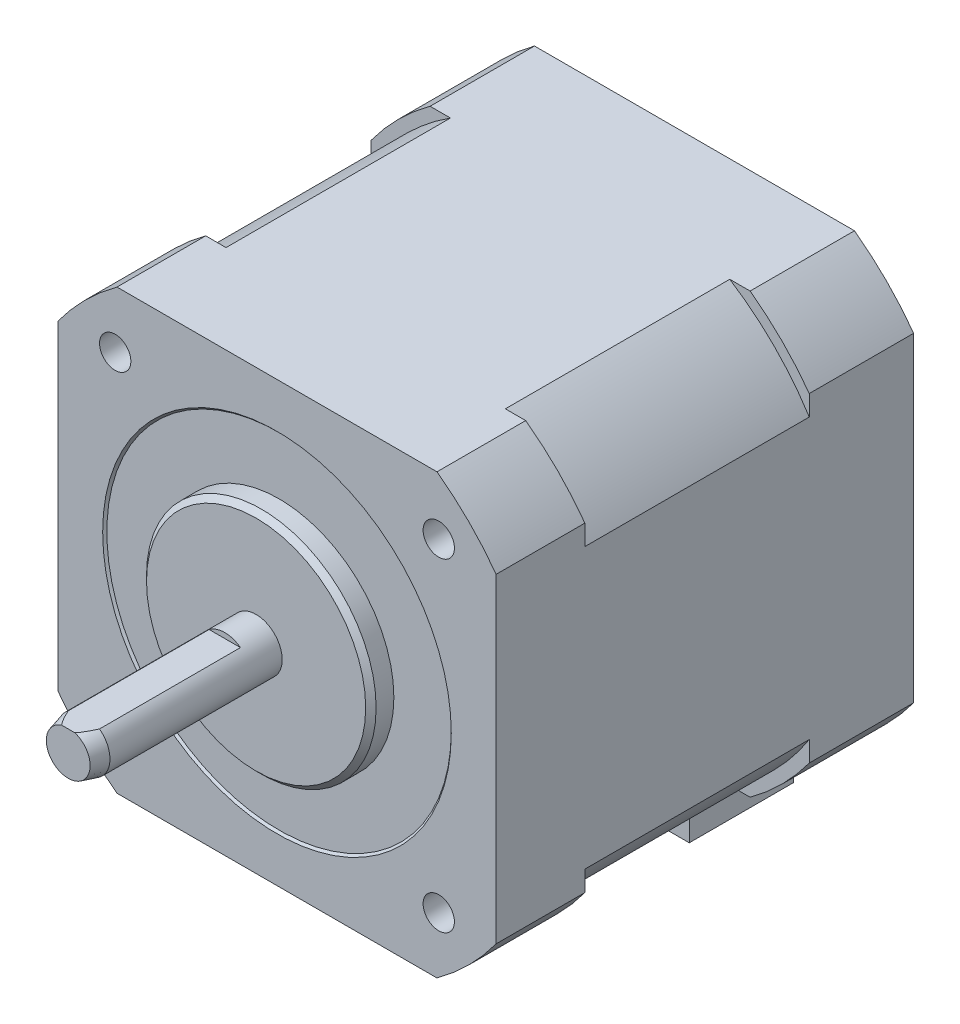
ISO-10303-21;
HEADER;
FILE_DESCRIPTION(('STEP AP214'),'2;1');
FILE_NAME('part.step','',(''),(''),'','','');
FILE_SCHEMA(('AUTOMOTIVE_DESIGN { 1 0 10303 214 1 1 1 1 }'));
ENDSEC;
DATA;
#1=APPLICATION_CONTEXT('core data for automotive mechanical design processes');
#2=APPLICATION_PROTOCOL_DEFINITION('international standard','automotive_design',2000,#1);
#3=PRODUCT_CONTEXT('',#1,'mechanical');
#4=PRODUCT('Part','Part','',(#3));
#5=PRODUCT_RELATED_PRODUCT_CATEGORY('part','',(#4));
#6=PRODUCT_DEFINITION_FORMATION('','',#4);
#7=PRODUCT_DEFINITION_CONTEXT('part definition',#1,'design');
#8=PRODUCT_DEFINITION('design','',#6,#7);
#9=PRODUCT_DEFINITION_SHAPE('','',#8);
#10=(LENGTH_UNIT() NAMED_UNIT(*) SI_UNIT(.MILLI.,.METRE.));
#11=(NAMED_UNIT(*) PLANE_ANGLE_UNIT() SI_UNIT($,.RADIAN.));
#12=(NAMED_UNIT(*) SI_UNIT($,.STERADIAN.) SOLID_ANGLE_UNIT());
#13=UNCERTAINTY_MEASURE_WITH_UNIT(LENGTH_MEASURE(1.E-05),#10,'distance_accuracy_value','');
#14=(GEOMETRIC_REPRESENTATION_CONTEXT(3) GLOBAL_UNCERTAINTY_ASSIGNED_CONTEXT((#13)) GLOBAL_UNIT_ASSIGNED_CONTEXT((#10,
#11,#12)) REPRESENTATION_CONTEXT('',''));
#15=CARTESIAN_POINT('',(0.,0.,0.));
#16=DIRECTION('',(0.,0.,1.));
#17=DIRECTION('',(1.,0.,0.));
#18=AXIS2_PLACEMENT_3D('',#15,#16,#17);
#19=CARTESIAN_POINT('',(0.,0.,-42.));
#20=DIRECTION('',(0.,0.,-1.));
#21=DIRECTION('',(-1.,0.,0.));
#22=AXIS2_PLACEMENT_3D('',#19,#20,#21);
#23=PLANE('',#22);
#24=CARTESIAN_POINT('',(0.,0.,-42.));
#25=DIRECTION('',(0.,0.,-1.));
#26=DIRECTION('',(-1.,0.,0.));
#27=AXIS2_PLACEMENT_3D('',#24,#25,#26);
#28=CIRCLE('',#27,2.5);
#29=CARTESIAN_POINT('',(1.5,2.,-42.));
#30=VERTEX_POINT('',#29);
#31=CARTESIAN_POINT('',(-1.5,2.,-42.));
#32=VERTEX_POINT('',#31);
#33=EDGE_CURVE('E284',#30,#32,#28,.T.);
#34=ORIENTED_EDGE('',*,*,#33,.F.);
#35=DIRECTION('',(-1.,0.,0.));
#36=VECTOR('',#35,1.);
#37=CARTESIAN_POINT('',(5.,2.,-42.));
#38=LINE('',#37,#36);
#39=EDGE_CURVE('E272',#30,#32,#38,.T.);
#40=ORIENTED_EDGE('',*,*,#39,.T.);
#41=EDGE_LOOP('',(#34,#40));
#42=FACE_BOUND('',#41,.T.);
#43=CARTESIAN_POINT('',(0.,0.,-42.));
#44=DIRECTION('',(0.,0.,-1.));
#45=DIRECTION('',(-1.,0.,0.));
#46=AXIS2_PLACEMENT_3D('',#43,#44,#45);
#47=CIRCLE('',#46,26.);
#48=CARTESIAN_POINT('',(15.3297097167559,21.,-42.));
#49=VERTEX_POINT('',#48);
#50=CARTESIAN_POINT('',(21.,15.3297097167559,-42.));
#51=VERTEX_POINT('',#50);
#52=EDGE_CURVE('E321',#49,#51,#47,.T.);
#53=ORIENTED_EDGE('',*,*,#52,.T.);
#54=DIRECTION('',(0.,-1.,0.));
#55=VECTOR('',#54,1.);
#56=CARTESIAN_POINT('',(21.,15.3297097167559,-42.));
#57=LINE('',#56,#55);
#58=CARTESIAN_POINT('',(21.,-15.3297097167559,-42.));
#59=VERTEX_POINT('',#58);
#60=EDGE_CURVE('E324',#51,#59,#57,.T.);
#61=ORIENTED_EDGE('',*,*,#60,.T.);
#62=CARTESIAN_POINT('',(0.,0.,-42.));
#63=DIRECTION('',(0.,0.,-1.));
#64=DIRECTION('',(-1.,0.,0.));
#65=AXIS2_PLACEMENT_3D('',#62,#63,#64);
#66=CIRCLE('',#65,26.);
#67=CARTESIAN_POINT('',(15.3297097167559,-21.,-42.));
#68=VERTEX_POINT('',#67);
#69=EDGE_CURVE('E327',#59,#68,#66,.T.);
#70=ORIENTED_EDGE('',*,*,#69,.T.);
#71=DIRECTION('',(-1.,0.,0.));
#72=VECTOR('',#71,1.);
#73=CARTESIAN_POINT('',(15.3297097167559,-21.,-42.));
#74=LINE('',#73,#72);
#75=CARTESIAN_POINT('',(9.5,-21.,-42.));
#76=VERTEX_POINT('',#75);
#77=EDGE_CURVE('E338',#68,#76,#74,.T.);
#78=ORIENTED_EDGE('',*,*,#77,.T.);
#79=DIRECTION('',(0.,1.,0.));
#80=VECTOR('',#79,1.);
#81=CARTESIAN_POINT('',(9.5,-27.7,-42.));
#82=LINE('',#81,#80);
#83=CARTESIAN_POINT('',(9.5,-27.7,-42.));
#84=VERTEX_POINT('',#83);
#85=EDGE_CURVE('E301',#84,#76,#82,.T.);
#86=ORIENTED_EDGE('',*,*,#85,.F.);
#87=DIRECTION('',(1.,0.,0.));
#88=VECTOR('',#87,1.);
#89=CARTESIAN_POINT('',(-9.5,-27.7,-42.));
#90=LINE('',#89,#88);
#91=CARTESIAN_POINT('',(-9.5,-27.7,-42.));
#92=VERTEX_POINT('',#91);
#93=EDGE_CURVE('E817',#92,#84,#90,.T.);
#94=ORIENTED_EDGE('',*,*,#93,.F.);
#95=DIRECTION('',(0.,1.,0.));
#96=VECTOR('',#95,1.);
#97=CARTESIAN_POINT('',(-9.5,-27.7,-42.));
#98=LINE('',#97,#96);
#99=CARTESIAN_POINT('',(-9.5,-21.0000000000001,-42.));
#100=VERTEX_POINT('',#99);
#101=EDGE_CURVE('E306',#92,#100,#98,.T.);
#102=ORIENTED_EDGE('',*,*,#101,.T.);
#103=CARTESIAN_POINT('',(-15.3297097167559,-21.,-42.));
#104=VERTEX_POINT('',#103);
#105=EDGE_CURVE('E329',#100,#104,#74,.T.);
#106=ORIENTED_EDGE('',*,*,#105,.T.);
#107=CARTESIAN_POINT('',(0.,0.,-42.));
#108=DIRECTION('',(0.,0.,-1.));
#109=DIRECTION('',(-1.,0.,0.));
#110=AXIS2_PLACEMENT_3D('',#107,#108,#109);
#111=CIRCLE('',#110,26.);
#112=CARTESIAN_POINT('',(-21.,-15.3297097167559,-42.));
#113=VERTEX_POINT('',#112);
#114=EDGE_CURVE('E332',#104,#113,#111,.T.);
#115=ORIENTED_EDGE('',*,*,#114,.T.);
#116=DIRECTION('',(0.,1.,0.));
#117=VECTOR('',#116,1.);
#118=CARTESIAN_POINT('',(-21.,-15.3297097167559,-42.));
#119=LINE('',#118,#117);
#120=CARTESIAN_POINT('',(-21.,15.3297097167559,-42.));
#121=VERTEX_POINT('',#120);
#122=EDGE_CURVE('E786',#113,#121,#119,.T.);
#123=ORIENTED_EDGE('',*,*,#122,.T.);
#124=CARTESIAN_POINT('',(0.,0.,-42.));
#125=DIRECTION('',(0.,0.,-1.));
#126=DIRECTION('',(-1.,0.,0.));
#127=AXIS2_PLACEMENT_3D('',#124,#125,#126);
#128=CIRCLE('',#127,26.);
#129=CARTESIAN_POINT('',(-15.3297097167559,21.,-42.));
#130=VERTEX_POINT('',#129);
#131=EDGE_CURVE('E784',#121,#130,#128,.T.);
#132=ORIENTED_EDGE('',*,*,#131,.T.);
#133=DIRECTION('',(1.,0.,0.));
#134=VECTOR('',#133,1.);
#135=CARTESIAN_POINT('',(-15.3297097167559,21.,-42.));
#136=LINE('',#135,#134);
#137=EDGE_CURVE('E779',#130,#49,#136,.T.);
#138=ORIENTED_EDGE('',*,*,#137,.T.);
#139=EDGE_LOOP('',(#53,#61,#70,#78,#86,#94,#102,#106,#115,#123,#132,#138));
#140=FACE_BOUND('',#139,.T.);
#141=ADVANCED_FACE('F38',(#42,#140),#23,.T.);
#142=CARTESIAN_POINT('',(21.,-21.,-10.5));
#143=DIRECTION('',(0.,1.,0.));
#144=DIRECTION('',(-1.,0.,0.));
#145=AXIS2_PLACEMENT_3D('',#142,#143,#144);
#146=PLANE('',#145);
#147=DIRECTION('',(0.,0.,-1.));
#148=VECTOR('',#147,1.);
#149=CARTESIAN_POINT('',(-9.5,-21.,-32.));
#150=LINE('',#149,#148);
#151=CARTESIAN_POINT('',(-9.5,-21.,-32.));
#152=VERTEX_POINT('',#151);
#153=EDGE_CURVE('E65',#152,#100,#150,.T.);
#154=ORIENTED_EDGE('',*,*,#153,.F.);
#155=DIRECTION('',(-1.,0.,0.));
#156=VECTOR('',#155,1.);
#157=CARTESIAN_POINT('',(-9.5,-21.,-32.));
#158=LINE('',#157,#156);
#159=CARTESIAN_POINT('',(9.5,-21.,-32.));
#160=VERTEX_POINT('',#159);
#161=EDGE_CURVE('E292',#160,#152,#158,.T.);
#162=ORIENTED_EDGE('',*,*,#161,.F.);
#163=DIRECTION('',(0.,0.,1.));
#164=VECTOR('',#163,1.);
#165=CARTESIAN_POINT('',(9.5,-21.,-32.));
#166=LINE('',#165,#164);
#167=EDGE_CURVE('E283',#76,#160,#166,.T.);
#168=ORIENTED_EDGE('',*,*,#167,.F.);
#169=ORIENTED_EDGE('',*,*,#77,.F.);
#170=DIRECTION('',(0.,0.,1.));
#171=VECTOR('',#170,1.);
#172=CARTESIAN_POINT('',(15.3297097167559,-21.,-42.));
#173=LINE('',#172,#171);
#174=CARTESIAN_POINT('',(15.3297097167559,-21.,-32.));
#175=VERTEX_POINT('',#174);
#176=EDGE_CURVE('E764',#68,#175,#173,.T.);
#177=ORIENTED_EDGE('',*,*,#176,.T.);
#178=DIRECTION('',(-1.,0.,0.));
#179=VECTOR('',#178,1.);
#180=CARTESIAN_POINT('',(-13.3794618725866,-21.,-32.));
#181=LINE('',#180,#179);
#182=CARTESIAN_POINT('',(13.3794618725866,-21.,-32.));
#183=VERTEX_POINT('',#182);
#184=EDGE_CURVE('E741',#175,#183,#181,.T.);
#185=ORIENTED_EDGE('',*,*,#184,.T.);
#186=DIRECTION('',(0.,0.,1.));
#187=VECTOR('',#186,1.);
#188=CARTESIAN_POINT('',(13.3794618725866,-21.,-32.));
#189=LINE('',#188,#187);
#190=CARTESIAN_POINT('',(13.3794618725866,-21.,-10.5));
#191=VERTEX_POINT('',#190);
#192=EDGE_CURVE('E599',#183,#191,#189,.T.);
#193=ORIENTED_EDGE('',*,*,#192,.T.);
#194=DIRECTION('',(-1.,0.,0.));
#195=VECTOR('',#194,1.);
#196=CARTESIAN_POINT('',(21.,-21.,-10.5));
#197=LINE('',#196,#195);
#198=CARTESIAN_POINT('',(15.3297097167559,-21.,-10.5));
#199=VERTEX_POINT('',#198);
#200=EDGE_CURVE('E503',#199,#191,#197,.T.);
#201=ORIENTED_EDGE('',*,*,#200,.F.);
#202=DIRECTION('',(0.,0.,1.));
#203=VECTOR('',#202,1.);
#204=CARTESIAN_POINT('',(15.3297097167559,-21.,-36.));
#205=LINE('',#204,#203);
#206=CARTESIAN_POINT('',(15.3297097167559,-21.,-2.));
#207=VERTEX_POINT('',#206);
#208=EDGE_CURVE('E567',#207,#199,#205,.F.);
#209=ORIENTED_EDGE('',*,*,#208,.F.);
#210=DIRECTION('',(-1.,0.,0.));
#211=VECTOR('',#210,1.);
#212=CARTESIAN_POINT('',(21.,-21.,-2.));
#213=LINE('',#212,#211);
#214=CARTESIAN_POINT('',(-15.3297097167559,-21.,-2.));
#215=VERTEX_POINT('',#214);
#216=EDGE_CURVE('E512',#207,#215,#213,.T.);
#217=ORIENTED_EDGE('',*,*,#216,.T.);
#218=DIRECTION('',(0.,0.,1.));
#219=VECTOR('',#218,1.);
#220=CARTESIAN_POINT('',(-15.3297097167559,-21.,-36.));
#221=LINE('',#220,#219);
#222=CARTESIAN_POINT('',(-15.3297097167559,-21.,-10.5));
#223=VERTEX_POINT('',#222);
#224=EDGE_CURVE('E571',#223,#215,#221,.T.);
#225=ORIENTED_EDGE('',*,*,#224,.F.);
#226=CARTESIAN_POINT('',(-13.3794618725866,-21.,-10.5));
#227=VERTEX_POINT('',#226);
#228=EDGE_CURVE('E509',#227,#223,#197,.T.);
#229=ORIENTED_EDGE('',*,*,#228,.F.);
#230=DIRECTION('',(0.,0.,1.));
#231=VECTOR('',#230,1.);
#232=CARTESIAN_POINT('',(-13.3794618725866,-21.,-32.));
#233=LINE('',#232,#231);
#234=CARTESIAN_POINT('',(-13.3794618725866,-21.,-32.));
#235=VERTEX_POINT('',#234);
#236=EDGE_CURVE('E1276',#235,#227,#233,.T.);
#237=ORIENTED_EDGE('',*,*,#236,.F.);
#238=CARTESIAN_POINT('',(-15.3297097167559,-21.,-32.));
#239=VERTEX_POINT('',#238);
#240=EDGE_CURVE('E734',#235,#239,#181,.T.);
#241=ORIENTED_EDGE('',*,*,#240,.T.);
#242=DIRECTION('',(0.,0.,1.));
#243=VECTOR('',#242,1.);
#244=CARTESIAN_POINT('',(-15.3297097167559,-21.,-42.));
#245=LINE('',#244,#243);
#246=EDGE_CURVE('E767',#104,#239,#245,.T.);
#247=ORIENTED_EDGE('',*,*,#246,.F.);
#248=ORIENTED_EDGE('',*,*,#105,.F.);
#249=EDGE_LOOP('',(#154,#162,#168,#169,#177,#185,#193,#201,#209,#217,#225,#229,#237,#241,#247,#248));
#250=FACE_BOUND('',#249,.T.);
#251=ADVANCED_FACE('F373',(#250),#146,.F.);
#252=CARTESIAN_POINT('',(0.,0.,18.));
#253=DIRECTION('',(0.,0.,-1.));
#254=DIRECTION('',(-1.,0.,0.));
#255=AXIS2_PLACEMENT_3D('',#252,#253,#254);
#256=CYLINDRICAL_SURFACE('',#255,2.5);
#257=CARTESIAN_POINT('',(0.,0.,16.4999999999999));
#258=DIRECTION('',(0.,0.,1.));
#259=DIRECTION('',(1.,0.,0.));
#260=AXIS2_PLACEMENT_3D('',#257,#258,#259);
#261=CIRCLE('',#260,2.5);
#262=CARTESIAN_POINT('',(1.5,2.,16.4999999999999));
#263=VERTEX_POINT('',#262);
#264=CARTESIAN_POINT('',(-1.49999999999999,2.,16.4999999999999));
#265=VERTEX_POINT('',#264);
#266=EDGE_CURVE('E356',#263,#265,#261,.F.);
#267=ORIENTED_EDGE('',*,*,#266,.T.);
#268=DIRECTION('',(0.,0.,-1.));
#269=VECTOR('',#268,1.);
#270=CARTESIAN_POINT('',(-1.5,2.,18.));
#271=LINE('',#270,#269);
#272=CARTESIAN_POINT('',(-1.5,2.,3.));
#273=VERTEX_POINT('',#272);
#274=EDGE_CURVE('E317',#265,#273,#271,.T.);
#275=ORIENTED_EDGE('',*,*,#274,.T.);
#276=CARTESIAN_POINT('',(0.,0.,3.));
#277=DIRECTION('',(0.,0.,1.));
#278=DIRECTION('',(1.,0.,0.));
#279=AXIS2_PLACEMENT_3D('',#276,#277,#278);
#280=CIRCLE('',#279,2.5);
#281=CARTESIAN_POINT('',(1.5,2.,3.));
#282=VERTEX_POINT('',#281);
#283=EDGE_CURVE('E346',#282,#273,#280,.T.);
#284=ORIENTED_EDGE('',*,*,#283,.F.);
#285=DIRECTION('',(0.,0.,-1.));
#286=VECTOR('',#285,1.);
#287=CARTESIAN_POINT('',(1.5,2.,18.));
#288=LINE('',#287,#286);
#289=EDGE_CURVE('E313',#282,#263,#288,.F.);
#290=ORIENTED_EDGE('',*,*,#289,.T.);
#291=EDGE_LOOP('',(#267,#275,#284,#290));
#292=FACE_BOUND('',#291,.T.);
#293=CARTESIAN_POINT('',(0.,0.,0.));
#294=DIRECTION('',(0.,0.,-1.));
#295=DIRECTION('',(-1.,0.,0.));
#296=AXIS2_PLACEMENT_3D('',#293,#294,#295);
#297=CIRCLE('',#296,2.5);
#298=CARTESIAN_POINT('',(-2.5,0.,0.));
#299=VERTEX_POINT('',#298);
#300=EDGE_CURVE('E500',#299,#299,#297,.T.);
#301=ORIENTED_EDGE('',*,*,#300,.F.);
#302=EDGE_LOOP('',(#301));
#303=FACE_BOUND('',#302,.T.);
#304=ADVANCED_FACE('F468',(#292,#303),#256,.T.);
#305=CARTESIAN_POINT('',(0.,0.,18.));
#306=DIRECTION('',(0.,0.,1.));
#307=DIRECTION('',(1.,0.,0.));
#308=AXIS2_PLACEMENT_3D('',#305,#306,#307);
#309=PLANE('',#308);
#310=DIRECTION('',(1.,0.,0.));
#311=VECTOR('',#310,1.);
#312=CARTESIAN_POINT('',(-4.72781232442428,2.,18.));
#313=LINE('',#312,#311);
#314=CARTESIAN_POINT('',(-0.633974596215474,2.,18.));
#315=VERTEX_POINT('',#314);
#316=CARTESIAN_POINT('',(0.633974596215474,2.,18.));
#317=VERTEX_POINT('',#316);
#318=EDGE_CURVE('E309',#315,#317,#313,.T.);
#319=ORIENTED_EDGE('',*,*,#318,.F.);
#320=CARTESIAN_POINT('',(0.,0.,18.));
#321=DIRECTION('',(0.,0.,1.));
#322=DIRECTION('',(1.,0.,0.));
#323=AXIS2_PLACEMENT_3D('',#320,#321,#322);
#324=CIRCLE('',#323,2.09807621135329);
#325=EDGE_CURVE('E1241',#315,#317,#324,.T.);
#326=ORIENTED_EDGE('',*,*,#325,.T.);
#327=EDGE_LOOP('',(#319,#326));
#328=FACE_BOUND('',#327,.T.);
#329=ADVANCED_FACE('F484',(#328),#309,.T.);
#330=CARTESIAN_POINT('',(0.,0.,0.));
#331=DIRECTION('',(0.,0.,-1.));
#332=DIRECTION('',(-1.,0.,0.));
#333=AXIS2_PLACEMENT_3D('',#330,#331,#332);
#334=PLANE('',#333);
#335=CARTESIAN_POINT('',(0.,0.,0.));
#336=DIRECTION('',(0.,0.,-1.));
#337=DIRECTION('',(-1.,0.,0.));
#338=AXIS2_PLACEMENT_3D('',#335,#336,#337);
#339=CIRCLE('',#338,10.5);
#340=CARTESIAN_POINT('',(-10.5,0.,0.));
#341=VERTEX_POINT('',#340);
#342=EDGE_CURVE('E278',#341,#341,#339,.F.);
#343=ORIENTED_EDGE('',*,*,#342,.T.);
#344=EDGE_LOOP('',(#343));
#345=FACE_BOUND('',#344,.T.);
#346=ORIENTED_EDGE('',*,*,#300,.T.);
#347=EDGE_LOOP('',(#346));
#348=FACE_BOUND('',#347,.T.);
#349=ADVANCED_FACE('F480',(#345,#348),#334,.F.);
#350=CARTESIAN_POINT('',(0.,0.,-2.));
#351=DIRECTION('',(0.,0.,1.));
#352=DIRECTION('',(1.,0.,0.));
#353=AXIS2_PLACEMENT_3D('',#350,#351,#352);
#354=CYLINDRICAL_SURFACE('',#353,11.);
#355=CARTESIAN_POINT('',(0.,0.,-0.499999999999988));
#356=DIRECTION('',(0.,0.,-1.));
#357=DIRECTION('',(-1.,0.,0.));
#358=AXIS2_PLACEMENT_3D('',#355,#356,#357);
#359=CIRCLE('',#358,11.);
#360=CARTESIAN_POINT('',(-11.,0.,-0.499999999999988));
#361=VERTEX_POINT('',#360);
#362=EDGE_CURVE('E343',#361,#361,#359,.T.);
#363=ORIENTED_EDGE('',*,*,#362,.T.);
#364=EDGE_LOOP('',(#363));
#365=FACE_BOUND('',#364,.T.);
#366=CARTESIAN_POINT('',(0.,0.,-2.2));
#367=DIRECTION('',(0.,0.,1.));
#368=DIRECTION('',(1.,0.,0.));
#369=AXIS2_PLACEMENT_3D('',#366,#367,#368);
#370=CIRCLE('',#369,11.);
#371=CARTESIAN_POINT('',(11.,0.,-2.2));
#372=VERTEX_POINT('',#371);
#373=EDGE_CURVE('E302',#372,#372,#370,.T.);
#374=ORIENTED_EDGE('',*,*,#373,.T.);
#375=EDGE_LOOP('',(#374));
#376=FACE_BOUND('',#375,.T.);
#377=ADVANCED_FACE('F483',(#365,#376),#354,.T.);
#378=CARTESIAN_POINT('',(0.,0.,18.));
#379=DIRECTION('',(0.,0.,-1.));
#380=DIRECTION('',(-1.,0.,0.));
#381=AXIS2_PLACEMENT_3D('',#378,#379,#380);
#382=CONICAL_SURFACE('',#381,2.09807621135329,0.261799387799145);
#383=CARTESIAN_POINT('',(-2.67411513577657,2.,13.3677080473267));
#384=CARTESIAN_POINT('',(-2.63311786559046,2.,13.4902257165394));
#385=CARTESIAN_POINT('',(-2.59182160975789,2.,13.6126436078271));
#386=CARTESIAN_POINT('',(-2.50853023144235,2.,13.8572444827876));
#387=CARTESIAN_POINT('',(-2.46653509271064,2.,13.9794274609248));
#388=CARTESIAN_POINT('',(-2.33928264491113,2.,14.34576464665));
#389=CARTESIAN_POINT('',(-2.25282589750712,2.,14.5895039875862));
#390=CARTESIAN_POINT('',(-2.07457613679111,2.,15.0781045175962));
#391=CARTESIAN_POINT('',(-1.98273458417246,2.,15.3229481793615));
#392=CARTESIAN_POINT('',(-1.84011140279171,2.,15.688262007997));
#393=CARTESIAN_POINT('',(-1.79177038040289,2.,15.8096838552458));
#394=CARTESIAN_POINT('',(-1.6930545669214,2.,16.0516959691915));
#395=CARTESIAN_POINT('',(-1.64267985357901,2.,16.1722862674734));
#396=CARTESIAN_POINT('',(-1.53950262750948,2.,16.4120087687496));
#397=CARTESIAN_POINT('',(-1.4867076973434,2.,16.5311442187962));
#398=CARTESIAN_POINT('',(-1.37773401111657,2.,16.7679408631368));
#399=CARTESIAN_POINT('',(-1.32155357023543,2.,16.8856012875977));
#400=CARTESIAN_POINT('',(-1.20458285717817,2.,17.1187131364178));
#401=CARTESIAN_POINT('',(-1.14379017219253,2.,17.2341633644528));
#402=CARTESIAN_POINT('',(-1.01570284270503,2.,17.4612984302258));
#403=CARTESIAN_POINT('',(-0.948415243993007,2.,17.5729871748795));
#404=CARTESIAN_POINT('',(-0.817363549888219,2.,17.7692701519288));
#405=CARTESIAN_POINT('',(-0.755348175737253,2.,17.8549879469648));
#406=CARTESIAN_POINT('',(-0.654778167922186,2.,17.9770588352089));
#407=CARTESIAN_POINT('',(-0.620094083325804,2.,18.0165731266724));
#408=CARTESIAN_POINT('',(-0.547506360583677,2.,18.092493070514));
#409=CARTESIAN_POINT('',(-0.509607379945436,2.,18.1289030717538));
#410=CARTESIAN_POINT('',(-0.439829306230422,2.,18.1884315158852));
#411=CARTESIAN_POINT('',(-0.40884422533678,2.,18.212585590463));
#412=CARTESIAN_POINT('',(-0.344218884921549,2.,18.2572111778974));
#413=CARTESIAN_POINT('',(-0.310575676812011,2.,18.2776785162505));
#414=CARTESIAN_POINT('',(-0.240012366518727,2.,18.3136158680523));
#415=CARTESIAN_POINT('',(-0.203051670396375,2.,18.3290087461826));
#416=CARTESIAN_POINT('',(-0.126881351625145,2.,18.3523462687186));
#417=CARTESIAN_POINT('',(-0.0876800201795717,2.,18.3603166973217));
#418=CARTESIAN_POINT('',(-0.0127311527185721,2.,18.367039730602));
#419=CARTESIAN_POINT('',(0.0229341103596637,2.,18.3666919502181));
#420=CARTESIAN_POINT('',(0.0935290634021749,2.,18.3590326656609));
#421=CARTESIAN_POINT('',(0.128457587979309,2.,18.3517108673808));
#422=CARTESIAN_POINT('',(0.201815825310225,2.,18.329553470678));
#423=CARTESIAN_POINT('',(0.239935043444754,2.,18.3137192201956));
#424=CARTESIAN_POINT('',(0.313185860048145,2.,18.276283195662));
#425=CARTESIAN_POINT('',(0.348311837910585,2.,18.2546708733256));
#426=CARTESIAN_POINT('',(0.443923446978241,2.,18.1877621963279));
#427=CARTESIAN_POINT('',(0.501075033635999,2.,18.1377652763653));
#428=CARTESIAN_POINT('',(0.581429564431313,2.,18.0575943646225));
#429=CARTESIAN_POINT('',(0.60737285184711,2.,18.0299378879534));
#430=CARTESIAN_POINT('',(0.657731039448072,2.,17.9732675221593));
#431=CARTESIAN_POINT('',(0.682146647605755,2.,17.9442542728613));
#432=CARTESIAN_POINT('',(0.749893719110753,2.,17.8601101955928));
#433=CARTESIAN_POINT('',(0.791668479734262,2.,17.8037362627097));
#434=CARTESIAN_POINT('',(0.871939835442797,2.,17.6886841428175));
#435=CARTESIAN_POINT('',(0.91043426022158,2.,17.6300044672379));
#436=CARTESIAN_POINT('',(0.984949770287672,2.,17.5109259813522));
#437=CARTESIAN_POINT('',(1.02096523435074,2.,17.4505236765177));
#438=CARTESIAN_POINT('',(1.09096213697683,2.,17.3285472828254));
#439=CARTESIAN_POINT('',(1.12494324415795,2.,17.2669730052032));
#440=CARTESIAN_POINT('',(1.22495399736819,2.,17.0799665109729));
#441=CARTESIAN_POINT('',(1.2884786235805,2.,16.9531970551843));
#442=CARTESIAN_POINT('',(1.41085483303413,2.,16.6976781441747));
#443=CARTESIAN_POINT('',(1.46971282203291,2.,16.5689317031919));
#444=CARTESIAN_POINT('',(1.58310001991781,2.,16.3121463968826));
#445=CARTESIAN_POINT('',(1.63768554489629,2.,16.1841322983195));
#446=CARTESIAN_POINT('',(1.7443631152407,2.,15.9270663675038));
#447=CARTESIAN_POINT('',(1.79645500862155,2.,15.7980144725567));
#448=CARTESIAN_POINT('',(1.94989108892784,2.,15.4094944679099));
#449=CARTESIAN_POINT('',(2.04830566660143,2.,15.1488712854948));
#450=CARTESIAN_POINT('',(2.23648040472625,2.,14.6352664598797));
#451=CARTESIAN_POINT('',(2.32642514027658,2.,14.3823515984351));
#452=CARTESIAN_POINT('',(2.45867006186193,2.,14.0022493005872));
#453=CARTESIAN_POINT('',(2.50227709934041,2.,13.8755147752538));
#454=CARTESIAN_POINT('',(2.58873482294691,2.,13.6217918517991));
#455=CARTESIAN_POINT('',(2.63158553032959,2.,13.4948034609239));
#456=CARTESIAN_POINT('',(2.67411513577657,2.,13.3677080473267));
#457=B_SPLINE_CURVE_WITH_KNOTS('',3,(#383,#384,#385,#386,#387,#388,#389,#390,#391,#392,#393,
#394,#395,#396,#397,#398,#399,#400,#401,#402,#403,#404,#405,#406,#407,#408,#409,#410,#411,#412,
#413,#414,#415,#416,#417,#418,#419,#420,#421,#422,#423,#424,#425,#426,#427,#428,#429,#430,#431,
#432,#433,#434,#435,#436,#437,#438,#439,#440,#441,#442,#443,#444,#445,#446,#447,#448,#449,#450,
#451,#452,#453,#454,#455,#456),.UNSPECIFIED.,.F.,.F.,(4,2,2,2,2,2,2,2,2,2,2,2,2,2,2,2,2,2,2,2,2,
2,2,2,2,2,2,2,2,2,2,2,2,2,2,2,4),(0.,0.387584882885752,0.775178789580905,1.5510087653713,
2.33544116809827,2.72750017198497,3.11954420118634,3.51043426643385,3.90152049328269,
4.2928127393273,4.68368517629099,5.00048531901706,5.15809093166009,5.31547199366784,
5.4331414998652,5.55094341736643,5.67046127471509,5.78956238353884,5.89584731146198,
6.00228936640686,6.12543181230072,6.24880061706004,6.47525140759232,6.58900607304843,
6.70270762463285,6.91302983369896,7.12349013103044,7.33441292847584,7.54536999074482,
7.97059745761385,8.3952307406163,8.81269313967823,9.23018095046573,10.0658395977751,
10.8711084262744,11.2731870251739,11.675254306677),.UNSPECIFIED.);
#458=EDGE_CURVE('E348',#265,#315,#457,.T.);
#459=ORIENTED_EDGE('',*,*,#458,.F.);
#460=ORIENTED_EDGE('',*,*,#266,.F.);
#461=EDGE_CURVE('E349',#317,#263,#457,.T.);
#462=ORIENTED_EDGE('',*,*,#461,.F.);
#463=ORIENTED_EDGE('',*,*,#325,.F.);
#464=EDGE_LOOP('',(#459,#460,#462,#463));
#465=FACE_BOUND('',#464,.T.);
#466=ADVANCED_FACE('F358',(#465),#382,.T.);
#467=CARTESIAN_POINT('',(0.,0.,3.));
#468=DIRECTION('',(0.,0.,1.));
#469=DIRECTION('',(1.,0.,0.));
#470=AXIS2_PLACEMENT_3D('',#467,#468,#469);
#471=PLANE('',#470);
#472=ORIENTED_EDGE('',*,*,#283,.T.);
#473=DIRECTION('',(1.,0.,0.));
#474=VECTOR('',#473,1.);
#475=CARTESIAN_POINT('',(-4.72781232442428,2.,3.));
#476=LINE('',#475,#474);
#477=EDGE_CURVE('E310',#273,#282,#476,.T.);
#478=ORIENTED_EDGE('',*,*,#477,.T.);
#479=EDGE_LOOP('',(#472,#478));
#480=FACE_BOUND('',#479,.T.);
#481=ADVANCED_FACE('F368',(#480),#471,.T.);
#482=CARTESIAN_POINT('',(-4.72781232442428,2.,3.));
#483=DIRECTION('',(0.,-1.,0.));
#484=DIRECTION('',(0.,0.,-1.));
#485=AXIS2_PLACEMENT_3D('',#482,#483,#484);
#486=PLANE('',#485);
#487=ORIENTED_EDGE('',*,*,#458,.T.);
#488=ORIENTED_EDGE('',*,*,#318,.T.);
#489=ORIENTED_EDGE('',*,*,#461,.T.);
#490=ORIENTED_EDGE('',*,*,#289,.F.);
#491=ORIENTED_EDGE('',*,*,#477,.F.);
#492=ORIENTED_EDGE('',*,*,#274,.F.);
#493=EDGE_LOOP('',(#487,#488,#489,#490,#491,#492));
#494=FACE_BOUND('',#493,.T.);
#495=ADVANCED_FACE('F362',(#494),#486,.F.);
#496=CARTESIAN_POINT('',(0.,0.,-2.2));
#497=DIRECTION('',(0.,0.,1.));
#498=DIRECTION('',(1.,0.,0.));
#499=AXIS2_PLACEMENT_3D('',#496,#497,#498);
#500=PLANE('',#499);
#501=ORIENTED_EDGE('',*,*,#373,.F.);
#502=EDGE_LOOP('',(#501));
#503=FACE_BOUND('',#502,.T.);
#504=CARTESIAN_POINT('',(0.,0.,-2.2));
#505=DIRECTION('',(0.,0.,1.));
#506=DIRECTION('',(1.,0.,0.));
#507=AXIS2_PLACEMENT_3D('',#504,#505,#506);
#508=CIRCLE('',#507,16.5);
#509=CARTESIAN_POINT('',(16.5,0.,-2.2));
#510=VERTEX_POINT('',#509);
#511=EDGE_CURVE('E305',#510,#510,#508,.T.);
#512=ORIENTED_EDGE('',*,*,#511,.T.);
#513=EDGE_LOOP('',(#512));
#514=FACE_BOUND('',#513,.T.);
#515=ADVANCED_FACE('F367',(#503,#514),#500,.T.);
#516=CARTESIAN_POINT('',(-21.,-21.,-10.5));
#517=DIRECTION('',(0.,0.,-1.));
#518=DIRECTION('',(-1.,0.,0.));
#519=AXIS2_PLACEMENT_3D('',#516,#517,#518);
#520=PLANE('',#519);
#521=CARTESIAN_POINT('',(0.,0.,-10.5));
#522=DIRECTION('',(0.,0.,-1.));
#523=DIRECTION('',(-1.,0.,0.));
#524=AXIS2_PLACEMENT_3D('',#521,#522,#523);
#525=CIRCLE('',#524,24.9);
#526=CARTESIAN_POINT('',(13.3794618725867,21.,-10.5));
#527=VERTEX_POINT('',#526);
#528=CARTESIAN_POINT('',(21.,13.3794618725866,-10.5));
#529=VERTEX_POINT('',#528);
#530=EDGE_CURVE('E549',#527,#529,#525,.T.);
#531=ORIENTED_EDGE('',*,*,#530,.F.);
#532=DIRECTION('',(1.,0.,0.));
#533=VECTOR('',#532,1.);
#534=CARTESIAN_POINT('',(21.,21.,-10.5));
#535=LINE('',#534,#533);
#536=CARTESIAN_POINT('',(15.3297097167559,21.,-10.5));
#537=VERTEX_POINT('',#536);
#538=EDGE_CURVE('E518',#527,#537,#535,.T.);
#539=ORIENTED_EDGE('',*,*,#538,.T.);
#540=CARTESIAN_POINT('',(0.,0.,-10.5));
#541=DIRECTION('',(0.,0.,-1.));
#542=DIRECTION('',(-1.,0.,0.));
#543=AXIS2_PLACEMENT_3D('',#540,#541,#542);
#544=CIRCLE('',#543,26.);
#545=CARTESIAN_POINT('',(21.,15.3297097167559,-10.5));
#546=VERTEX_POINT('',#545);
#547=EDGE_CURVE('E546',#537,#546,#544,.T.);
#548=ORIENTED_EDGE('',*,*,#547,.T.);
#549=DIRECTION('',(0.,-1.,0.));
#550=VECTOR('',#549,1.);
#551=CARTESIAN_POINT('',(21.,21.,-10.5));
#552=LINE('',#551,#550);
#553=EDGE_CURVE('E540',#546,#529,#552,.T.);
#554=ORIENTED_EDGE('',*,*,#553,.T.);
#555=EDGE_LOOP('',(#531,#539,#548,#554));
#556=FACE_BOUND('',#555,.T.);
#557=ADVANCED_FACE('F404',(#556),#520,.T.);
#558=CARTESIAN_POINT('',(0.,0.,-32.));
#559=DIRECTION('',(0.,0.,1.));
#560=DIRECTION('',(1.,0.,0.));
#561=AXIS2_PLACEMENT_3D('',#558,#559,#560);
#562=CYLINDRICAL_SURFACE('',#561,24.9);
#563=ORIENTED_EDGE('',*,*,#530,.T.);
#564=DIRECTION('',(0.,0.,1.));
#565=VECTOR('',#564,1.);
#566=CARTESIAN_POINT('',(21.,13.3794618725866,-32.));
#567=LINE('',#566,#565);
#568=CARTESIAN_POINT('',(21.0000000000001,13.3794618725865,-32.));
#569=VERTEX_POINT('',#568);
#570=EDGE_CURVE('E613',#569,#529,#567,.T.);
#571=ORIENTED_EDGE('',*,*,#570,.F.);
#572=CARTESIAN_POINT('',(0.,0.,-32.));
#573=DIRECTION('',(0.,0.,-1.));
#574=DIRECTION('',(-1.,0.,0.));
#575=AXIS2_PLACEMENT_3D('',#572,#573,#574);
#576=CIRCLE('',#575,24.9);
#577=CARTESIAN_POINT('',(13.3794618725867,21.,-32.));
#578=VERTEX_POINT('',#577);
#579=EDGE_CURVE('E636',#578,#569,#576,.T.);
#580=ORIENTED_EDGE('',*,*,#579,.F.);
#581=DIRECTION('',(0.,0.,1.));
#582=VECTOR('',#581,1.);
#583=CARTESIAN_POINT('',(13.3794618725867,21.,-32.));
#584=LINE('',#583,#582);
#585=EDGE_CURVE('E616',#578,#527,#584,.T.);
#586=ORIENTED_EDGE('',*,*,#585,.T.);
#587=EDGE_LOOP('',(#563,#571,#580,#586));
#588=FACE_BOUND('',#587,.T.);
#589=ADVANCED_FACE('F401',(#588),#562,.T.);
#590=CARTESIAN_POINT('',(0.,0.,-32.));
#591=DIRECTION('',(0.,0.,-1.));
#592=DIRECTION('',(-1.,0.,0.));
#593=AXIS2_PLACEMENT_3D('',#590,#591,#592);
#594=PLANE('',#593);
#595=DIRECTION('',(1.,0.,0.));
#596=VECTOR('',#595,1.);
#597=CARTESIAN_POINT('',(13.3794618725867,21.,-32.));
#598=LINE('',#597,#596);
#599=CARTESIAN_POINT('',(15.3297097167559,21.,-32.));
#600=VERTEX_POINT('',#599);
#601=EDGE_CURVE('E752',#578,#600,#598,.T.);
#602=ORIENTED_EDGE('',*,*,#601,.F.);
#603=ORIENTED_EDGE('',*,*,#579,.T.);
#604=DIRECTION('',(0.,-1.,0.));
#605=VECTOR('',#604,1.);
#606=CARTESIAN_POINT('',(21.,-13.3794618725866,-32.));
#607=LINE('',#606,#605);
#608=CARTESIAN_POINT('',(21.,15.3297097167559,-32.));
#609=VERTEX_POINT('',#608);
#610=EDGE_CURVE('E724',#609,#569,#607,.T.);
#611=ORIENTED_EDGE('',*,*,#610,.F.);
#612=CARTESIAN_POINT('',(0.,0.,-32.));
#613=DIRECTION('',(0.,0.,-1.));
#614=DIRECTION('',(-1.,0.,0.));
#615=AXIS2_PLACEMENT_3D('',#612,#613,#614);
#616=CIRCLE('',#615,26.);
#617=EDGE_CURVE('E320',#600,#609,#616,.T.);
#618=ORIENTED_EDGE('',*,*,#617,.F.);
#619=EDGE_LOOP('',(#602,#603,#611,#618));
#620=FACE_BOUND('',#619,.T.);
#621=ADVANCED_FACE('F382',(#620),#594,.F.);
#622=CARTESIAN_POINT('',(0.,0.,-42.));
#623=DIRECTION('',(0.,0.,1.));
#624=DIRECTION('',(1.,0.,0.));
#625=AXIS2_PLACEMENT_3D('',#622,#623,#624);
#626=CYLINDRICAL_SURFACE('',#625,26.);
#627=ORIENTED_EDGE('',*,*,#617,.T.);
#628=DIRECTION('',(0.,0.,1.));
#629=VECTOR('',#628,1.);
#630=CARTESIAN_POINT('',(21.,15.3297097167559,-42.));
#631=LINE('',#630,#629);
#632=EDGE_CURVE('E653',#51,#609,#631,.T.);
#633=ORIENTED_EDGE('',*,*,#632,.F.);
#634=ORIENTED_EDGE('',*,*,#52,.F.);
#635=DIRECTION('',(0.,0.,1.));
#636=VECTOR('',#635,1.);
#637=CARTESIAN_POINT('',(15.3297097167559,21.,-42.));
#638=LINE('',#637,#636);
#639=EDGE_CURVE('E755',#49,#600,#638,.T.);
#640=ORIENTED_EDGE('',*,*,#639,.T.);
#641=EDGE_LOOP('',(#627,#633,#634,#640));
#642=FACE_BOUND('',#641,.T.);
#643=ADVANCED_FACE('F396',(#642),#626,.T.);
#644=CARTESIAN_POINT('',(0.,0.,-10.5));
#645=DIRECTION('',(0.,0.,-1.));
#646=DIRECTION('',(-1.,0.,0.));
#647=AXIS2_PLACEMENT_3D('',#644,#645,#646);
#648=CIRCLE('',#647,24.9);
#649=CARTESIAN_POINT('',(21.,-13.3794618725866,-10.5));
#650=VERTEX_POINT('',#649);
#651=EDGE_CURVE('E650',#650,#191,#648,.T.);
#652=ORIENTED_EDGE('',*,*,#651,.F.);
#653=CARTESIAN_POINT('',(21.,-15.3297097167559,-10.5));
#654=VERTEX_POINT('',#653);
#655=EDGE_CURVE('E535',#650,#654,#552,.T.);
#656=ORIENTED_EDGE('',*,*,#655,.T.);
#657=EDGE_CURVE('E506',#654,#199,#544,.T.);
#658=ORIENTED_EDGE('',*,*,#657,.T.);
#659=ORIENTED_EDGE('',*,*,#200,.T.);
#660=EDGE_LOOP('',(#652,#656,#658,#659));
#661=FACE_BOUND('',#660,.T.);
#662=ADVANCED_FACE('F399',(#661),#520,.T.);
#663=CARTESIAN_POINT('',(0.,0.,-32.));
#664=DIRECTION('',(0.,0.,1.));
#665=DIRECTION('',(1.,0.,0.));
#666=AXIS2_PLACEMENT_3D('',#663,#664,#665);
#667=CYLINDRICAL_SURFACE('',#666,24.9);
#668=ORIENTED_EDGE('',*,*,#651,.T.);
#669=ORIENTED_EDGE('',*,*,#192,.F.);
#670=CARTESIAN_POINT('',(0.,0.,-32.));
#671=DIRECTION('',(0.,0.,-1.));
#672=DIRECTION('',(-1.,0.,0.));
#673=AXIS2_PLACEMENT_3D('',#670,#671,#672);
#674=CIRCLE('',#673,24.9);
#675=CARTESIAN_POINT('',(21.,-13.3794618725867,-32.));
#676=VERTEX_POINT('',#675);
#677=EDGE_CURVE('E609',#676,#183,#674,.T.);
#678=ORIENTED_EDGE('',*,*,#677,.F.);
#679=DIRECTION('',(0.,0.,1.));
#680=VECTOR('',#679,1.);
#681=CARTESIAN_POINT('',(21.,-13.3794618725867,-32.));
#682=LINE('',#681,#680);
#683=EDGE_CURVE('E617',#676,#650,#682,.T.);
#684=ORIENTED_EDGE('',*,*,#683,.T.);
#685=EDGE_LOOP('',(#668,#669,#678,#684));
#686=FACE_BOUND('',#685,.T.);
#687=ADVANCED_FACE('F379',(#686),#667,.T.);
#688=CARTESIAN_POINT('',(21.,-15.3297097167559,-32.));
#689=VERTEX_POINT('',#688);
#690=EDGE_CURVE('E663',#676,#689,#607,.T.);
#691=ORIENTED_EDGE('',*,*,#690,.F.);
#692=ORIENTED_EDGE('',*,*,#677,.T.);
#693=ORIENTED_EDGE('',*,*,#184,.F.);
#694=CARTESIAN_POINT('',(0.,0.,-32.));
#695=DIRECTION('',(0.,0.,-1.));
#696=DIRECTION('',(-1.,0.,0.));
#697=AXIS2_PLACEMENT_3D('',#694,#695,#696);
#698=CIRCLE('',#697,26.);
#699=EDGE_CURVE('E730',#689,#175,#698,.T.);
#700=ORIENTED_EDGE('',*,*,#699,.F.);
#701=EDGE_LOOP('',(#691,#692,#693,#700));
#702=FACE_BOUND('',#701,.T.);
#703=ADVANCED_FACE('F375',(#702),#594,.F.);
#704=CARTESIAN_POINT('',(0.,0.,-42.));
#705=DIRECTION('',(0.,0.,1.));
#706=DIRECTION('',(1.,0.,0.));
#707=AXIS2_PLACEMENT_3D('',#704,#705,#706);
#708=CYLINDRICAL_SURFACE('',#707,26.);
#709=ORIENTED_EDGE('',*,*,#699,.T.);
#710=ORIENTED_EDGE('',*,*,#176,.F.);
#711=ORIENTED_EDGE('',*,*,#69,.F.);
#712=DIRECTION('',(0.,0.,1.));
#713=VECTOR('',#712,1.);
#714=CARTESIAN_POINT('',(21.,-15.3297097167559,-42.));
#715=LINE('',#714,#713);
#716=EDGE_CURVE('E762',#59,#689,#715,.T.);
#717=ORIENTED_EDGE('',*,*,#716,.T.);
#718=EDGE_LOOP('',(#709,#710,#711,#717));
#719=FACE_BOUND('',#718,.T.);
#720=ADVANCED_FACE('F378',(#719),#708,.T.);
#721=CARTESIAN_POINT('',(0.,0.,-10.5));
#722=DIRECTION('',(0.,0.,-1.));
#723=DIRECTION('',(-1.,0.,0.));
#724=AXIS2_PLACEMENT_3D('',#721,#722,#723);
#725=CIRCLE('',#724,24.9);
#726=CARTESIAN_POINT('',(-21.,-13.3794618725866,-10.5));
#727=VERTEX_POINT('',#726);
#728=EDGE_CURVE('E625',#227,#727,#725,.T.);
#729=ORIENTED_EDGE('',*,*,#728,.F.);
#730=ORIENTED_EDGE('',*,*,#228,.T.);
#731=CARTESIAN_POINT('',(-21.,-15.3297097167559,-10.5));
#732=VERTEX_POINT('',#731);
#733=EDGE_CURVE('E502',#223,#732,#544,.T.);
#734=ORIENTED_EDGE('',*,*,#733,.T.);
#735=DIRECTION('',(0.,1.,0.));
#736=VECTOR('',#735,1.);
#737=CARTESIAN_POINT('',(-21.,21.,-10.5));
#738=LINE('',#737,#736);
#739=EDGE_CURVE('E515',#732,#727,#738,.T.);
#740=ORIENTED_EDGE('',*,*,#739,.T.);
#741=EDGE_LOOP('',(#729,#730,#734,#740));
#742=FACE_BOUND('',#741,.T.);
#743=ADVANCED_FACE('F394',(#742),#520,.T.);
#744=CARTESIAN_POINT('',(0.,0.,-32.));
#745=DIRECTION('',(0.,0.,1.));
#746=DIRECTION('',(1.,0.,0.));
#747=AXIS2_PLACEMENT_3D('',#744,#745,#746);
#748=CYLINDRICAL_SURFACE('',#747,24.9);
#749=ORIENTED_EDGE('',*,*,#728,.T.);
#750=DIRECTION('',(0.,0.,1.));
#751=VECTOR('',#750,1.);
#752=CARTESIAN_POINT('',(-21.,-13.3794618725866,-32.));
#753=LINE('',#752,#751);
#754=CARTESIAN_POINT('',(-21.,-13.3794618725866,-32.));
#755=VERTEX_POINT('',#754);
#756=EDGE_CURVE('E633',#755,#727,#753,.T.);
#757=ORIENTED_EDGE('',*,*,#756,.F.);
#758=CARTESIAN_POINT('',(0.,0.,-32.));
#759=DIRECTION('',(0.,0.,-1.));
#760=DIRECTION('',(-1.,0.,0.));
#761=AXIS2_PLACEMENT_3D('',#758,#759,#760);
#762=CIRCLE('',#761,24.9);
#763=EDGE_CURVE('E711',#235,#755,#762,.T.);
#764=ORIENTED_EDGE('',*,*,#763,.F.);
#765=ORIENTED_EDGE('',*,*,#236,.T.);
#766=EDGE_LOOP('',(#749,#757,#764,#765));
#767=FACE_BOUND('',#766,.T.);
#768=ADVANCED_FACE('F411',(#767),#748,.T.);
#769=ORIENTED_EDGE('',*,*,#240,.F.);
#770=ORIENTED_EDGE('',*,*,#763,.T.);
#771=DIRECTION('',(0.,1.,0.));
#772=VECTOR('',#771,1.);
#773=CARTESIAN_POINT('',(-21.,13.3794618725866,-32.));
#774=LINE('',#773,#772);
#775=CARTESIAN_POINT('',(-21.,-15.3297097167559,-32.));
#776=VERTEX_POINT('',#775);
#777=EDGE_CURVE('E745',#776,#755,#774,.T.);
#778=ORIENTED_EDGE('',*,*,#777,.F.);
#779=CARTESIAN_POINT('',(0.,0.,-32.));
#780=DIRECTION('',(0.,0.,-1.));
#781=DIRECTION('',(-1.,0.,0.));
#782=AXIS2_PLACEMENT_3D('',#779,#780,#781);
#783=CIRCLE('',#782,26.);
#784=EDGE_CURVE('E737',#239,#776,#783,.T.);
#785=ORIENTED_EDGE('',*,*,#784,.F.);
#786=EDGE_LOOP('',(#769,#770,#778,#785));
#787=FACE_BOUND('',#786,.T.);
#788=ADVANCED_FACE('F381',(#787),#594,.F.);
#789=CARTESIAN_POINT('',(0.,0.,-42.));
#790=DIRECTION('',(0.,0.,1.));
#791=DIRECTION('',(1.,0.,0.));
#792=AXIS2_PLACEMENT_3D('',#789,#790,#791);
#793=CYLINDRICAL_SURFACE('',#792,26.);
#794=ORIENTED_EDGE('',*,*,#784,.T.);
#795=DIRECTION('',(0.,0.,1.));
#796=VECTOR('',#795,1.);
#797=CARTESIAN_POINT('',(-21.,-15.3297097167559,-42.));
#798=LINE('',#797,#796);
#799=EDGE_CURVE('E770',#113,#776,#798,.T.);
#800=ORIENTED_EDGE('',*,*,#799,.F.);
#801=ORIENTED_EDGE('',*,*,#114,.F.);
#802=ORIENTED_EDGE('',*,*,#246,.T.);
#803=EDGE_LOOP('',(#794,#800,#801,#802));
#804=FACE_BOUND('',#803,.T.);
#805=ADVANCED_FACE('F387',(#804),#793,.T.);
#806=CARTESIAN_POINT('',(0.,0.,-42.));
#807=DIRECTION('',(0.,0.,1.));
#808=DIRECTION('',(1.,0.,0.));
#809=AXIS2_PLACEMENT_3D('',#806,#807,#808);
#810=CYLINDRICAL_SURFACE('',#809,26.);
#811=CARTESIAN_POINT('',(0.,0.,-32.));
#812=DIRECTION('',(0.,0.,-1.));
#813=DIRECTION('',(-1.,0.,0.));
#814=AXIS2_PLACEMENT_3D('',#811,#812,#813);
#815=CIRCLE('',#814,26.);
#816=CARTESIAN_POINT('',(-21.,15.3297097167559,-32.));
#817=VERTEX_POINT('',#816);
#818=CARTESIAN_POINT('',(-15.3297097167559,21.,-32.));
#819=VERTEX_POINT('',#818);
#820=EDGE_CURVE('E749',#817,#819,#815,.T.);
#821=ORIENTED_EDGE('',*,*,#820,.T.);
#822=DIRECTION('',(0.,0.,1.));
#823=VECTOR('',#822,1.);
#824=CARTESIAN_POINT('',(-15.3297097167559,21.,-42.));
#825=LINE('',#824,#823);
#826=EDGE_CURVE('E775',#130,#819,#825,.T.);
#827=ORIENTED_EDGE('',*,*,#826,.F.);
#828=ORIENTED_EDGE('',*,*,#131,.F.);
#829=DIRECTION('',(0.,0.,1.));
#830=VECTOR('',#829,1.);
#831=CARTESIAN_POINT('',(-21.,15.3297097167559,-42.));
#832=LINE('',#831,#830);
#833=EDGE_CURVE('E773',#121,#817,#832,.T.);
#834=ORIENTED_EDGE('',*,*,#833,.T.);
#835=EDGE_LOOP('',(#821,#827,#828,#834));
#836=FACE_BOUND('',#835,.T.);
#837=ADVANCED_FACE('F383',(#836),#810,.T.);
#838=CARTESIAN_POINT('',(-21.,13.3794618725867,-32.));
#839=VERTEX_POINT('',#838);
#840=EDGE_CURVE('E710',#839,#817,#774,.T.);
#841=ORIENTED_EDGE('',*,*,#840,.F.);
#842=CARTESIAN_POINT('',(0.,0.,-32.));
#843=DIRECTION('',(0.,0.,-1.));
#844=DIRECTION('',(-1.,0.,0.));
#845=AXIS2_PLACEMENT_3D('',#842,#843,#844);
#846=CIRCLE('',#845,24.9);
#847=CARTESIAN_POINT('',(-13.3794618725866,21.,-32.));
#848=VERTEX_POINT('',#847);
#849=EDGE_CURVE('E640',#839,#848,#846,.T.);
#850=ORIENTED_EDGE('',*,*,#849,.T.);
#851=EDGE_CURVE('E325',#819,#848,#598,.T.);
#852=ORIENTED_EDGE('',*,*,#851,.F.);
#853=ORIENTED_EDGE('',*,*,#820,.F.);
#854=EDGE_LOOP('',(#841,#850,#852,#853));
#855=FACE_BOUND('',#854,.T.);
#856=ADVANCED_FACE('F386',(#855),#594,.F.);
#857=CARTESIAN_POINT('',(0.,0.,-32.));
#858=DIRECTION('',(0.,0.,1.));
#859=DIRECTION('',(1.,0.,0.));
#860=AXIS2_PLACEMENT_3D('',#857,#858,#859);
#861=CYLINDRICAL_SURFACE('',#860,24.9);
#862=CARTESIAN_POINT('',(0.,0.,-10.5));
#863=DIRECTION('',(0.,0.,-1.));
#864=DIRECTION('',(-1.,0.,0.));
#865=AXIS2_PLACEMENT_3D('',#862,#863,#864);
#866=CIRCLE('',#865,24.9);
#867=CARTESIAN_POINT('',(-21.,13.3794618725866,-10.5));
#868=VERTEX_POINT('',#867);
#869=CARTESIAN_POINT('',(-13.3794618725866,21.,-10.5));
#870=VERTEX_POINT('',#869);
#871=EDGE_CURVE('E610',#868,#870,#866,.T.);
#872=ORIENTED_EDGE('',*,*,#871,.T.);
#873=DIRECTION('',(0.,0.,1.));
#874=VECTOR('',#873,1.);
#875=CARTESIAN_POINT('',(-13.3794618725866,21.,-32.));
#876=LINE('',#875,#874);
#877=EDGE_CURVE('E621',#848,#870,#876,.T.);
#878=ORIENTED_EDGE('',*,*,#877,.F.);
#879=ORIENTED_EDGE('',*,*,#849,.F.);
#880=DIRECTION('',(0.,0.,1.));
#881=VECTOR('',#880,1.);
#882=CARTESIAN_POINT('',(-21.,13.3794618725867,-32.));
#883=LINE('',#882,#881);
#884=EDGE_CURVE('E628',#839,#868,#883,.T.);
#885=ORIENTED_EDGE('',*,*,#884,.T.);
#886=EDGE_LOOP('',(#872,#878,#879,#885));
#887=FACE_BOUND('',#886,.T.);
#888=ADVANCED_FACE('F406',(#887),#861,.T.);
#889=ORIENTED_EDGE('',*,*,#871,.F.);
#890=CARTESIAN_POINT('',(-21.,15.3297097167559,-10.5));
#891=VERTEX_POINT('',#890);
#892=EDGE_CURVE('E519',#868,#891,#738,.T.);
#893=ORIENTED_EDGE('',*,*,#892,.T.);
#894=CARTESIAN_POINT('',(-15.3297097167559,21.,-10.5));
#895=VERTEX_POINT('',#894);
#896=EDGE_CURVE('E508',#891,#895,#544,.T.);
#897=ORIENTED_EDGE('',*,*,#896,.T.);
#898=EDGE_CURVE('E534',#895,#870,#535,.T.);
#899=ORIENTED_EDGE('',*,*,#898,.T.);
#900=EDGE_LOOP('',(#889,#893,#897,#899));
#901=FACE_BOUND('',#900,.T.);
#902=ADVANCED_FACE('F409',(#901),#520,.T.);
#903=CARTESIAN_POINT('',(-15.5,15.5,-6.5));
#904=DIRECTION('',(0.,0.,1.));
#905=DIRECTION('',(1.,0.,0.));
#906=AXIS2_PLACEMENT_3D('',#903,#904,#905);
#907=PLANE('',#906);
#908=CARTESIAN_POINT('',(-15.5,15.5,-6.5));
#909=DIRECTION('',(0.,0.,1.));
#910=DIRECTION('',(1.,0.,0.));
#911=AXIS2_PLACEMENT_3D('',#908,#909,#910);
#912=CIRCLE('',#911,1.5);
#913=CARTESIAN_POINT('',(-14.,15.5,-6.5));
#914=VERTEX_POINT('',#913);
#915=EDGE_CURVE('E580',#914,#914,#912,.T.);
#916=ORIENTED_EDGE('',*,*,#915,.T.);
#917=EDGE_LOOP('',(#916));
#918=FACE_BOUND('',#917,.T.);
#919=ADVANCED_FACE('F440',(#918),#907,.T.);
#920=CARTESIAN_POINT('',(15.5,15.5,-6.5));
#921=DIRECTION('',(0.,0.,1.));
#922=DIRECTION('',(1.,0.,0.));
#923=AXIS2_PLACEMENT_3D('',#920,#921,#922);
#924=PLANE('',#923);
#925=CARTESIAN_POINT('',(15.5,15.5,-6.5));
#926=DIRECTION('',(0.,0.,1.));
#927=DIRECTION('',(1.,0.,0.));
#928=AXIS2_PLACEMENT_3D('',#925,#926,#927);
#929=CIRCLE('',#928,1.5);
#930=CARTESIAN_POINT('',(17.,15.5,-6.5));
#931=VERTEX_POINT('',#930);
#932=EDGE_CURVE('E581',#931,#931,#929,.T.);
#933=ORIENTED_EDGE('',*,*,#932,.T.);
#934=EDGE_LOOP('',(#933));
#935=FACE_BOUND('',#934,.T.);
#936=ADVANCED_FACE('F432',(#935),#924,.T.);
#937=CARTESIAN_POINT('',(15.5,-15.5,-6.5));
#938=DIRECTION('',(0.,0.,1.));
#939=DIRECTION('',(1.,0.,0.));
#940=AXIS2_PLACEMENT_3D('',#937,#938,#939);
#941=PLANE('',#940);
#942=CARTESIAN_POINT('',(15.5,-15.5,-6.5));
#943=DIRECTION('',(0.,0.,1.));
#944=DIRECTION('',(1.,0.,0.));
#945=AXIS2_PLACEMENT_3D('',#942,#943,#944);
#946=CIRCLE('',#945,1.5);
#947=CARTESIAN_POINT('',(17.,-15.5,-6.5));
#948=VERTEX_POINT('',#947);
#949=EDGE_CURVE('E587',#948,#948,#946,.T.);
#950=ORIENTED_EDGE('',*,*,#949,.T.);
#951=EDGE_LOOP('',(#950));
#952=FACE_BOUND('',#951,.T.);
#953=ADVANCED_FACE('F422',(#952),#941,.T.);
#954=CARTESIAN_POINT('',(-15.5,-15.5,-6.5));
#955=DIRECTION('',(0.,0.,1.));
#956=DIRECTION('',(1.,0.,0.));
#957=AXIS2_PLACEMENT_3D('',#954,#955,#956);
#958=PLANE('',#957);
#959=CARTESIAN_POINT('',(-15.5,-15.5,-6.5));
#960=DIRECTION('',(0.,0.,1.));
#961=DIRECTION('',(1.,0.,0.));
#962=AXIS2_PLACEMENT_3D('',#959,#960,#961);
#963=CIRCLE('',#962,1.5);
#964=CARTESIAN_POINT('',(-14.,-15.5,-6.5));
#965=VERTEX_POINT('',#964);
#966=EDGE_CURVE('E593',#965,#965,#963,.T.);
#967=ORIENTED_EDGE('',*,*,#966,.T.);
#968=EDGE_LOOP('',(#967));
#969=FACE_BOUND('',#968,.T.);
#970=ADVANCED_FACE('F418',(#969),#958,.T.);
#971=CARTESIAN_POINT('',(21.,21.,-10.5));
#972=DIRECTION('',(0.,-1.,0.));
#973=DIRECTION('',(0.,0.,-1.));
#974=AXIS2_PLACEMENT_3D('',#971,#972,#973);
#975=PLANE('',#974);
#976=DIRECTION('',(0.,0.,1.));
#977=VECTOR('',#976,1.);
#978=CARTESIAN_POINT('',(15.3297097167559,21.,-36.));
#979=LINE('',#978,#977);
#980=CARTESIAN_POINT('',(15.3297097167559,21.,-2.));
#981=VERTEX_POINT('',#980);
#982=EDGE_CURVE('E553',#537,#981,#979,.T.);
#983=ORIENTED_EDGE('',*,*,#982,.F.);
#984=ORIENTED_EDGE('',*,*,#538,.F.);
#985=ORIENTED_EDGE('',*,*,#585,.F.);
#986=ORIENTED_EDGE('',*,*,#601,.T.);
#987=ORIENTED_EDGE('',*,*,#639,.F.);
#988=ORIENTED_EDGE('',*,*,#137,.F.);
#989=ORIENTED_EDGE('',*,*,#826,.T.);
#990=ORIENTED_EDGE('',*,*,#851,.T.);
#991=ORIENTED_EDGE('',*,*,#877,.T.);
#992=ORIENTED_EDGE('',*,*,#898,.F.);
#993=DIRECTION('',(0.,0.,1.));
#994=VECTOR('',#993,1.);
#995=CARTESIAN_POINT('',(-15.3297097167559,21.,-36.));
#996=LINE('',#995,#994);
#997=CARTESIAN_POINT('',(-15.3297097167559,21.,-2.));
#998=VERTEX_POINT('',#997);
#999=EDGE_CURVE('E561',#998,#895,#996,.F.);
#1000=ORIENTED_EDGE('',*,*,#999,.F.);
#1001=DIRECTION('',(1.,0.,0.));
#1002=VECTOR('',#1001,1.);
#1003=CARTESIAN_POINT('',(21.,21.,-2.));
#1004=LINE('',#1003,#1002);
#1005=EDGE_CURVE('E560',#998,#981,#1004,.T.);
#1006=ORIENTED_EDGE('',*,*,#1005,.T.);
#1007=EDGE_LOOP('',(#983,#984,#985,#986,#987,#988,#989,#990,#991,#992,#1000,#1006));
#1008=FACE_BOUND('',#1007,.T.);
#1009=ADVANCED_FACE('F421',(#1008),#975,.F.);
#1010=CARTESIAN_POINT('',(0.,0.,-36.));
#1011=DIRECTION('',(0.,0.,1.));
#1012=DIRECTION('',(1.,0.,0.));
#1013=AXIS2_PLACEMENT_3D('',#1010,#1011,#1012);
#1014=CYLINDRICAL_SURFACE('',#1013,26.);
#1015=ORIENTED_EDGE('',*,*,#982,.T.);
#1016=CARTESIAN_POINT('',(0.,0.,-2.));
#1017=DIRECTION('',(0.,0.,1.));
#1018=DIRECTION('',(1.,0.,0.));
#1019=AXIS2_PLACEMENT_3D('',#1016,#1017,#1018);
#1020=CIRCLE('',#1019,26.);
#1021=CARTESIAN_POINT('',(21.,15.3297097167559,-2.));
#1022=VERTEX_POINT('',#1021);
#1023=EDGE_CURVE('E573',#1022,#981,#1020,.T.);
#1024=ORIENTED_EDGE('',*,*,#1023,.F.);
#1025=DIRECTION('',(0.,0.,1.));
#1026=VECTOR('',#1025,1.);
#1027=CARTESIAN_POINT('',(21.,15.3297097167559,-36.));
#1028=LINE('',#1027,#1026);
#1029=EDGE_CURVE('E556',#1022,#546,#1028,.F.);
#1030=ORIENTED_EDGE('',*,*,#1029,.T.);
#1031=ORIENTED_EDGE('',*,*,#547,.F.);
#1032=EDGE_LOOP('',(#1015,#1024,#1030,#1031));
#1033=FACE_BOUND('',#1032,.T.);
#1034=ADVANCED_FACE('F457',(#1033),#1014,.T.);
#1035=CARTESIAN_POINT('',(21.,21.,-10.5));
#1036=DIRECTION('',(-1.,0.,0.));
#1037=DIRECTION('',(0.,-1.,0.));
#1038=AXIS2_PLACEMENT_3D('',#1035,#1036,#1037);
#1039=PLANE('',#1038);
#1040=DIRECTION('',(0.,0.,1.));
#1041=VECTOR('',#1040,1.);
#1042=CARTESIAN_POINT('',(21.,-15.3297097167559,-36.));
#1043=LINE('',#1042,#1041);
#1044=CARTESIAN_POINT('',(21.,-15.3297097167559,-2.));
#1045=VERTEX_POINT('',#1044);
#1046=EDGE_CURVE('E563',#654,#1045,#1043,.T.);
#1047=ORIENTED_EDGE('',*,*,#1046,.F.);
#1048=ORIENTED_EDGE('',*,*,#655,.F.);
#1049=ORIENTED_EDGE('',*,*,#683,.F.);
#1050=ORIENTED_EDGE('',*,*,#690,.T.);
#1051=ORIENTED_EDGE('',*,*,#716,.F.);
#1052=ORIENTED_EDGE('',*,*,#60,.F.);
#1053=ORIENTED_EDGE('',*,*,#632,.T.);
#1054=ORIENTED_EDGE('',*,*,#610,.T.);
#1055=ORIENTED_EDGE('',*,*,#570,.T.);
#1056=ORIENTED_EDGE('',*,*,#553,.F.);
#1057=ORIENTED_EDGE('',*,*,#1029,.F.);
#1058=DIRECTION('',(0.,-1.,0.));
#1059=VECTOR('',#1058,1.);
#1060=CARTESIAN_POINT('',(21.,21.,-2.));
#1061=LINE('',#1060,#1059);
#1062=EDGE_CURVE('E683',#1022,#1045,#1061,.T.);
#1063=ORIENTED_EDGE('',*,*,#1062,.T.);
#1064=EDGE_LOOP('',(#1047,#1048,#1049,#1050,#1051,#1052,#1053,#1054,#1055,#1056,#1057,#1063));
#1065=FACE_BOUND('',#1064,.T.);
#1066=ADVANCED_FACE('F469',(#1065),#1039,.F.);
#1067=ORIENTED_EDGE('',*,*,#1046,.T.);
#1068=EDGE_CURVE('E576',#207,#1045,#1020,.T.);
#1069=ORIENTED_EDGE('',*,*,#1068,.F.);
#1070=ORIENTED_EDGE('',*,*,#208,.T.);
#1071=ORIENTED_EDGE('',*,*,#657,.F.);
#1072=EDGE_LOOP('',(#1067,#1069,#1070,#1071));
#1073=FACE_BOUND('',#1072,.T.);
#1074=ADVANCED_FACE('F472',(#1073),#1014,.T.);
#1075=DIRECTION('',(0.,0.,1.));
#1076=VECTOR('',#1075,1.);
#1077=CARTESIAN_POINT('',(-21.,-15.3297097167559,-36.));
#1078=LINE('',#1077,#1076);
#1079=CARTESIAN_POINT('',(-21.,-15.3297097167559,-2.));
#1080=VERTEX_POINT('',#1079);
#1081=EDGE_CURVE('E569',#1080,#732,#1078,.F.);
#1082=ORIENTED_EDGE('',*,*,#1081,.T.);
#1083=ORIENTED_EDGE('',*,*,#733,.F.);
#1084=ORIENTED_EDGE('',*,*,#224,.T.);
#1085=EDGE_CURVE('E682',#1080,#215,#1020,.T.);
#1086=ORIENTED_EDGE('',*,*,#1085,.F.);
#1087=EDGE_LOOP('',(#1082,#1083,#1084,#1086));
#1088=FACE_BOUND('',#1087,.T.);
#1089=ADVANCED_FACE('F458',(#1088),#1014,.T.);
#1090=CARTESIAN_POINT('',(-21.,21.,-10.5));
#1091=DIRECTION('',(1.,0.,0.));
#1092=DIRECTION('',(0.,1.,0.));
#1093=AXIS2_PLACEMENT_3D('',#1090,#1091,#1092);
#1094=PLANE('',#1093);
#1095=DIRECTION('',(0.,0.,1.));
#1096=VECTOR('',#1095,1.);
#1097=CARTESIAN_POINT('',(-21.,15.3297097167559,-36.));
#1098=LINE('',#1097,#1096);
#1099=CARTESIAN_POINT('',(-21.,15.3297097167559,-2.));
#1100=VERTEX_POINT('',#1099);
#1101=EDGE_CURVE('E524',#891,#1100,#1098,.T.);
#1102=ORIENTED_EDGE('',*,*,#1101,.F.);
#1103=ORIENTED_EDGE('',*,*,#892,.F.);
#1104=ORIENTED_EDGE('',*,*,#884,.F.);
#1105=ORIENTED_EDGE('',*,*,#840,.T.);
#1106=ORIENTED_EDGE('',*,*,#833,.F.);
#1107=ORIENTED_EDGE('',*,*,#122,.F.);
#1108=ORIENTED_EDGE('',*,*,#799,.T.);
#1109=ORIENTED_EDGE('',*,*,#777,.T.);
#1110=ORIENTED_EDGE('',*,*,#756,.T.);
#1111=ORIENTED_EDGE('',*,*,#739,.F.);
#1112=ORIENTED_EDGE('',*,*,#1081,.F.);
#1113=DIRECTION('',(0.,1.,0.));
#1114=VECTOR('',#1113,1.);
#1115=CARTESIAN_POINT('',(-21.,21.,-2.));
#1116=LINE('',#1115,#1114);
#1117=EDGE_CURVE('E684',#1080,#1100,#1116,.T.);
#1118=ORIENTED_EDGE('',*,*,#1117,.T.);
#1119=EDGE_LOOP('',(#1102,#1103,#1104,#1105,#1106,#1107,#1108,#1109,#1110,#1111,#1112,#1118));
#1120=FACE_BOUND('',#1119,.T.);
#1121=ADVANCED_FACE('F455',(#1120),#1094,.F.);
#1122=ORIENTED_EDGE('',*,*,#1101,.T.);
#1123=EDGE_CURVE('E575',#998,#1100,#1020,.T.);
#1124=ORIENTED_EDGE('',*,*,#1123,.F.);
#1125=ORIENTED_EDGE('',*,*,#999,.T.);
#1126=ORIENTED_EDGE('',*,*,#896,.F.);
#1127=EDGE_LOOP('',(#1122,#1124,#1125,#1126));
#1128=FACE_BOUND('',#1127,.T.);
#1129=ADVANCED_FACE('F451',(#1128),#1014,.T.);
#1130=CARTESIAN_POINT('',(-15.5,15.5,-6.5));
#1131=DIRECTION('',(0.,0.,1.));
#1132=DIRECTION('',(1.,0.,0.));
#1133=AXIS2_PLACEMENT_3D('',#1130,#1131,#1132);
#1134=CYLINDRICAL_SURFACE('',#1133,1.5);
#1135=ORIENTED_EDGE('',*,*,#915,.F.);
#1136=EDGE_LOOP('',(#1135));
#1137=FACE_BOUND('',#1136,.T.);
#1138=CARTESIAN_POINT('',(-15.5,15.5,-2.));
#1139=DIRECTION('',(0.,0.,1.));
#1140=DIRECTION('',(1.,0.,0.));
#1141=AXIS2_PLACEMENT_3D('',#1138,#1139,#1140);
#1142=CIRCLE('',#1141,1.5);
#1143=CARTESIAN_POINT('',(-14.,15.5,-2.));
#1144=VERTEX_POINT('',#1143);
#1145=EDGE_CURVE('E577',#1144,#1144,#1142,.T.);
#1146=ORIENTED_EDGE('',*,*,#1145,.T.);
#1147=EDGE_LOOP('',(#1146));
#1148=FACE_BOUND('',#1147,.T.);
#1149=ADVANCED_FACE('F444',(#1137,#1148),#1134,.F.);
#1150=CARTESIAN_POINT('',(15.5,15.5,-6.5));
#1151=DIRECTION('',(0.,0.,1.));
#1152=DIRECTION('',(1.,0.,0.));
#1153=AXIS2_PLACEMENT_3D('',#1150,#1151,#1152);
#1154=CYLINDRICAL_SURFACE('',#1153,1.5);
#1155=ORIENTED_EDGE('',*,*,#932,.F.);
#1156=EDGE_LOOP('',(#1155));
#1157=FACE_BOUND('',#1156,.T.);
#1158=CARTESIAN_POINT('',(15.5,15.5,-2.));
#1159=DIRECTION('',(0.,0.,1.));
#1160=DIRECTION('',(1.,0.,0.));
#1161=AXIS2_PLACEMENT_3D('',#1158,#1159,#1160);
#1162=CIRCLE('',#1161,1.5);
#1163=CARTESIAN_POINT('',(17.,15.5,-2.));
#1164=VERTEX_POINT('',#1163);
#1165=EDGE_CURVE('E584',#1164,#1164,#1162,.T.);
#1166=ORIENTED_EDGE('',*,*,#1165,.T.);
#1167=EDGE_LOOP('',(#1166));
#1168=FACE_BOUND('',#1167,.T.);
#1169=ADVANCED_FACE('F436',(#1157,#1168),#1154,.F.);
#1170=CARTESIAN_POINT('',(15.5,-15.5,-6.5));
#1171=DIRECTION('',(0.,0.,1.));
#1172=DIRECTION('',(1.,0.,0.));
#1173=AXIS2_PLACEMENT_3D('',#1170,#1171,#1172);
#1174=CYLINDRICAL_SURFACE('',#1173,1.5);
#1175=ORIENTED_EDGE('',*,*,#949,.F.);
#1176=EDGE_LOOP('',(#1175));
#1177=FACE_BOUND('',#1176,.T.);
#1178=CARTESIAN_POINT('',(15.5,-15.5,-2.));
#1179=DIRECTION('',(0.,0.,1.));
#1180=DIRECTION('',(1.,0.,0.));
#1181=AXIS2_PLACEMENT_3D('',#1178,#1179,#1180);
#1182=CIRCLE('',#1181,1.5);
#1183=CARTESIAN_POINT('',(17.,-15.5,-2.));
#1184=VERTEX_POINT('',#1183);
#1185=EDGE_CURVE('E590',#1184,#1184,#1182,.T.);
#1186=ORIENTED_EDGE('',*,*,#1185,.T.);
#1187=EDGE_LOOP('',(#1186));
#1188=FACE_BOUND('',#1187,.T.);
#1189=ADVANCED_FACE('F428',(#1177,#1188),#1174,.F.);
#1190=CARTESIAN_POINT('',(-15.5,-15.5,-6.5));
#1191=DIRECTION('',(0.,0.,1.));
#1192=DIRECTION('',(1.,0.,0.));
#1193=AXIS2_PLACEMENT_3D('',#1190,#1191,#1192);
#1194=CYLINDRICAL_SURFACE('',#1193,1.5);
#1195=ORIENTED_EDGE('',*,*,#966,.F.);
#1196=EDGE_LOOP('',(#1195));
#1197=FACE_BOUND('',#1196,.T.);
#1198=CARTESIAN_POINT('',(-15.5,-15.5,-2.));
#1199=DIRECTION('',(0.,0.,1.));
#1200=DIRECTION('',(1.,0.,0.));
#1201=AXIS2_PLACEMENT_3D('',#1198,#1199,#1200);
#1202=CIRCLE('',#1201,1.5);
#1203=CARTESIAN_POINT('',(-14.,-15.5,-2.));
#1204=VERTEX_POINT('',#1203);
#1205=EDGE_CURVE('E596',#1204,#1204,#1202,.T.);
#1206=ORIENTED_EDGE('',*,*,#1205,.T.);
#1207=EDGE_LOOP('',(#1206));
#1208=FACE_BOUND('',#1207,.T.);
#1209=ADVANCED_FACE('F424',(#1197,#1208),#1194,.F.);
#1210=CARTESIAN_POINT('',(-21.,-21.,-2.));
#1211=DIRECTION('',(0.,0.,-1.));
#1212=DIRECTION('',(-1.,0.,0.));
#1213=AXIS2_PLACEMENT_3D('',#1210,#1211,#1212);
#1214=PLANE('',#1213);
#1215=CARTESIAN_POINT('',(0.,0.,-2.));
#1216=DIRECTION('',(0.,0.,-1.));
#1217=DIRECTION('',(-1.,0.,0.));
#1218=AXIS2_PLACEMENT_3D('',#1215,#1216,#1217);
#1219=CIRCLE('',#1218,16.7);
#1220=CARTESIAN_POINT('',(-16.7,0.,-2.));
#1221=VERTEX_POINT('',#1220);
#1222=EDGE_CURVE('E275',#1221,#1221,#1219,.T.);
#1223=ORIENTED_EDGE('',*,*,#1222,.T.);
#1224=EDGE_LOOP('',(#1223));
#1225=FACE_BOUND('',#1224,.T.);
#1226=ORIENTED_EDGE('',*,*,#1205,.F.);
#1227=EDGE_LOOP('',(#1226));
#1228=FACE_BOUND('',#1227,.T.);
#1229=ORIENTED_EDGE('',*,*,#1185,.F.);
#1230=EDGE_LOOP('',(#1229));
#1231=FACE_BOUND('',#1230,.T.);
#1232=ORIENTED_EDGE('',*,*,#1165,.F.);
#1233=EDGE_LOOP('',(#1232));
#1234=FACE_BOUND('',#1233,.T.);
#1235=ORIENTED_EDGE('',*,*,#1145,.F.);
#1236=EDGE_LOOP('',(#1235));
#1237=FACE_BOUND('',#1236,.T.);
#1238=ORIENTED_EDGE('',*,*,#1123,.T.);
#1239=ORIENTED_EDGE('',*,*,#1117,.F.);
#1240=ORIENTED_EDGE('',*,*,#1085,.T.);
#1241=ORIENTED_EDGE('',*,*,#216,.F.);
#1242=ORIENTED_EDGE('',*,*,#1068,.T.);
#1243=ORIENTED_EDGE('',*,*,#1062,.F.);
#1244=ORIENTED_EDGE('',*,*,#1023,.T.);
#1245=ORIENTED_EDGE('',*,*,#1005,.F.);
#1246=EDGE_LOOP('',(#1238,#1239,#1240,#1241,#1242,#1243,#1244,#1245));
#1247=FACE_BOUND('',#1246,.T.);
#1248=ADVANCED_FACE('F427',(#1225,#1228,#1231,#1234,#1237,#1247),#1214,.F.);
#1249=CARTESIAN_POINT('',(0.,0.,-0.499999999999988));
#1250=DIRECTION('',(0.,0.,-1.));
#1251=DIRECTION('',(-1.,0.,0.));
#1252=AXIS2_PLACEMENT_3D('',#1249,#1250,#1251);
#1253=CONICAL_SURFACE('',#1252,11.,0.78539816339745);
#1254=ORIENTED_EDGE('',*,*,#342,.F.);
#1255=EDGE_LOOP('',(#1254));
#1256=FACE_BOUND('',#1255,.T.);
#1257=ORIENTED_EDGE('',*,*,#362,.F.);
#1258=EDGE_LOOP('',(#1257));
#1259=FACE_BOUND('',#1258,.T.);
#1260=ADVANCED_FACE('F464',(#1256,#1259),#1253,.T.);
#1261=CARTESIAN_POINT('',(0.,0.,-2.2));
#1262=DIRECTION('',(0.,0.,1.));
#1263=DIRECTION('',(1.,0.,0.));
#1264=AXIS2_PLACEMENT_3D('',#1261,#1262,#1263);
#1265=CONICAL_SURFACE('',#1264,16.5,0.785398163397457);
#1266=ORIENTED_EDGE('',*,*,#1222,.F.);
#1267=EDGE_LOOP('',(#1266));
#1268=FACE_BOUND('',#1267,.T.);
#1269=ORIENTED_EDGE('',*,*,#511,.F.);
#1270=EDGE_LOOP('',(#1269));
#1271=FACE_BOUND('',#1270,.T.);
#1272=ADVANCED_FACE('F855',(#1268,#1271),#1265,.F.);
#1273=CARTESIAN_POINT('',(-9.5,-27.7,-32.));
#1274=DIRECTION('',(1.,0.,0.));
#1275=DIRECTION('',(0.,0.,-1.));
#1276=AXIS2_PLACEMENT_3D('',#1273,#1274,#1275);
#1277=PLANE('',#1276);
#1278=ORIENTED_EDGE('',*,*,#153,.T.);
#1279=ORIENTED_EDGE('',*,*,#101,.F.);
#1280=DIRECTION('',(0.,0.,-1.));
#1281=VECTOR('',#1280,1.);
#1282=CARTESIAN_POINT('',(-9.5,-27.7,-32.));
#1283=LINE('',#1282,#1281);
#1284=CARTESIAN_POINT('',(-9.5,-27.7,-32.));
#1285=VERTEX_POINT('',#1284);
#1286=EDGE_CURVE('E294',#1285,#92,#1283,.T.);
#1287=ORIENTED_EDGE('',*,*,#1286,.F.);
#1288=DIRECTION('',(0.,1.,0.));
#1289=VECTOR('',#1288,1.);
#1290=CARTESIAN_POINT('',(-9.5,-27.7,-32.));
#1291=LINE('',#1290,#1289);
#1292=EDGE_CURVE('E295',#1285,#152,#1291,.T.);
#1293=ORIENTED_EDGE('',*,*,#1292,.T.);
#1294=EDGE_LOOP('',(#1278,#1279,#1287,#1293));
#1295=FACE_BOUND('',#1294,.T.);
#1296=ADVANCED_FACE('F821',(#1295),#1277,.F.);
#1297=CARTESIAN_POINT('',(9.5,-27.7,-32.));
#1298=DIRECTION('',(-1.,0.,0.));
#1299=DIRECTION('',(0.,-1.,0.));
#1300=AXIS2_PLACEMENT_3D('',#1297,#1298,#1299);
#1301=PLANE('',#1300);
#1302=ORIENTED_EDGE('',*,*,#167,.T.);
#1303=DIRECTION('',(0.,1.,0.));
#1304=VECTOR('',#1303,1.);
#1305=CARTESIAN_POINT('',(9.5,-27.7,-32.));
#1306=LINE('',#1305,#1304);
#1307=CARTESIAN_POINT('',(9.5,-27.7,-32.));
#1308=VERTEX_POINT('',#1307);
#1309=EDGE_CURVE('E298',#1308,#160,#1306,.T.);
#1310=ORIENTED_EDGE('',*,*,#1309,.F.);
#1311=DIRECTION('',(0.,0.,1.));
#1312=VECTOR('',#1311,1.);
#1313=CARTESIAN_POINT('',(9.5,-27.7,-32.));
#1314=LINE('',#1313,#1312);
#1315=EDGE_CURVE('E810',#84,#1308,#1314,.T.);
#1316=ORIENTED_EDGE('',*,*,#1315,.F.);
#1317=ORIENTED_EDGE('',*,*,#85,.T.);
#1318=EDGE_LOOP('',(#1302,#1310,#1316,#1317));
#1319=FACE_BOUND('',#1318,.T.);
#1320=ADVANCED_FACE('F808',(#1319),#1301,.F.);
#1321=CARTESIAN_POINT('',(-9.5,-27.7,-32.));
#1322=DIRECTION('',(0.,0.,-1.));
#1323=DIRECTION('',(-1.,0.,0.));
#1324=AXIS2_PLACEMENT_3D('',#1321,#1322,#1323);
#1325=PLANE('',#1324);
#1326=ORIENTED_EDGE('',*,*,#161,.T.);
#1327=ORIENTED_EDGE('',*,*,#1292,.F.);
#1328=DIRECTION('',(-1.,0.,0.));
#1329=VECTOR('',#1328,1.);
#1330=CARTESIAN_POINT('',(-9.5,-27.7,-32.));
#1331=LINE('',#1330,#1329);
#1332=EDGE_CURVE('E290',#1308,#1285,#1331,.T.);
#1333=ORIENTED_EDGE('',*,*,#1332,.F.);
#1334=ORIENTED_EDGE('',*,*,#1309,.T.);
#1335=EDGE_LOOP('',(#1326,#1327,#1333,#1334));
#1336=FACE_BOUND('',#1335,.T.);
#1337=ADVANCED_FACE('F825',(#1336),#1325,.F.);
#1338=CARTESIAN_POINT('',(0.,-27.7,0.));
#1339=DIRECTION('',(0.,-1.,0.));
#1340=DIRECTION('',(0.,0.,-1.));
#1341=AXIS2_PLACEMENT_3D('',#1338,#1339,#1340);
#1342=PLANE('',#1341);
#1343=ORIENTED_EDGE('',*,*,#1286,.T.);
#1344=ORIENTED_EDGE('',*,*,#93,.T.);
#1345=ORIENTED_EDGE('',*,*,#1315,.T.);
#1346=ORIENTED_EDGE('',*,*,#1332,.T.);
#1347=EDGE_LOOP('',(#1343,#1344,#1345,#1346));
#1348=FACE_BOUND('',#1347,.T.);
#1349=ADVANCED_FACE('F841',(#1348),#1342,.T.);
#1350=CARTESIAN_POINT('',(0.,0.,-57.));
#1351=DIRECTION('',(0.,0.,1.));
#1352=DIRECTION('',(1.,0.,0.));
#1353=AXIS2_PLACEMENT_3D('',#1350,#1351,#1352);
#1354=CYLINDRICAL_SURFACE('',#1353,2.5);
#1355=CARTESIAN_POINT('',(0.,0.,-55.5));
#1356=DIRECTION('',(0.,0.,-1.));
#1357=DIRECTION('',(-1.,0.,0.));
#1358=AXIS2_PLACEMENT_3D('',#1355,#1356,#1357);
#1359=CIRCLE('',#1358,2.5);
#1360=CARTESIAN_POINT('',(-1.5,2.,-55.5));
#1361=VERTEX_POINT('',#1360);
#1362=CARTESIAN_POINT('',(1.5,2.,-55.5));
#1363=VERTEX_POINT('',#1362);
#1364=EDGE_CURVE('E274',#1361,#1363,#1359,.F.);
#1365=ORIENTED_EDGE('',*,*,#1364,.T.);
#1366=DIRECTION('',(0.,0.,1.));
#1367=VECTOR('',#1366,1.);
#1368=CARTESIAN_POINT('',(1.5,2.,-57.));
#1369=LINE('',#1368,#1367);
#1370=EDGE_CURVE('E263',#1363,#30,#1369,.T.);
#1371=ORIENTED_EDGE('',*,*,#1370,.T.);
#1372=ORIENTED_EDGE('',*,*,#33,.T.);
#1373=DIRECTION('',(0.,0.,1.));
#1374=VECTOR('',#1373,1.);
#1375=CARTESIAN_POINT('',(-1.5,2.,-57.));
#1376=LINE('',#1375,#1374);
#1377=EDGE_CURVE('E833',#32,#1361,#1376,.F.);
#1378=ORIENTED_EDGE('',*,*,#1377,.T.);
#1379=EDGE_LOOP('',(#1365,#1371,#1372,#1378));
#1380=FACE_BOUND('',#1379,.T.);
#1381=ADVANCED_FACE('F839',(#1380),#1354,.T.);
#1382=CARTESIAN_POINT('',(0.,0.,-57.));
#1383=DIRECTION('',(0.,0.,-1.));
#1384=DIRECTION('',(-1.,0.,0.));
#1385=AXIS2_PLACEMENT_3D('',#1382,#1383,#1384);
#1386=PLANE('',#1385);
#1387=DIRECTION('',(-1.,0.,0.));
#1388=VECTOR('',#1387,1.);
#1389=CARTESIAN_POINT('',(5.,2.,-57.));
#1390=LINE('',#1389,#1388);
#1391=CARTESIAN_POINT('',(0.63397459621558,2.,-57.));
#1392=VERTEX_POINT('',#1391);
#1393=CARTESIAN_POINT('',(-0.63397459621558,2.,-57.));
#1394=VERTEX_POINT('',#1393);
#1395=EDGE_CURVE('E57',#1392,#1394,#1390,.T.);
#1396=ORIENTED_EDGE('',*,*,#1395,.F.);
#1397=CARTESIAN_POINT('',(0.,0.,-57.));
#1398=DIRECTION('',(0.,0.,-1.));
#1399=DIRECTION('',(-1.,0.,0.));
#1400=AXIS2_PLACEMENT_3D('',#1397,#1398,#1399);
#1401=CIRCLE('',#1400,2.09807621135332);
#1402=EDGE_CURVE('E271',#1392,#1394,#1401,.T.);
#1403=ORIENTED_EDGE('',*,*,#1402,.T.);
#1404=EDGE_LOOP('',(#1396,#1403));
#1405=FACE_BOUND('',#1404,.T.);
#1406=ADVANCED_FACE('F270',(#1405),#1386,.T.);
#1407=CARTESIAN_POINT('',(0.,0.,-57.));
#1408=DIRECTION('',(0.,0.,1.));
#1409=DIRECTION('',(1.,0.,0.));
#1410=AXIS2_PLACEMENT_3D('',#1407,#1408,#1409);
#1411=CONICAL_SURFACE('',#1410,2.09807621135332,0.261799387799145);
#1412=CARTESIAN_POINT('',(2.67411513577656,2.,-52.3677080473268));
#1413=CARTESIAN_POINT('',(2.63311786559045,2.,-52.4902257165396));
#1414=CARTESIAN_POINT('',(2.59182160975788,2.,-52.6126436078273));
#1415=CARTESIAN_POINT('',(2.50853023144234,2.,-52.8572444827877));
#1416=CARTESIAN_POINT('',(2.46653509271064,2.,-52.979427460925));
#1417=CARTESIAN_POINT('',(2.33928264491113,2.,-53.3457646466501));
#1418=CARTESIAN_POINT('',(2.25282589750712,2.,-53.5895039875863));
#1419=CARTESIAN_POINT('',(2.07457613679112,2.,-54.0781045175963));
#1420=CARTESIAN_POINT('',(1.98273458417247,2.,-54.3229481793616));
#1421=CARTESIAN_POINT('',(1.84011140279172,2.,-54.6882620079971));
#1422=CARTESIAN_POINT('',(1.7917703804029,2.,-54.8096838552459));
#1423=CARTESIAN_POINT('',(1.69305456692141,2.,-55.0516959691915));
#1424=CARTESIAN_POINT('',(1.64267985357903,2.,-55.1722862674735));
#1425=CARTESIAN_POINT('',(1.5395026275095,2.,-55.4120087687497));
#1426=CARTESIAN_POINT('',(1.48670769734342,2.,-55.5311442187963));
#1427=CARTESIAN_POINT('',(1.3777340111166,2.,-55.7679408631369));
#1428=CARTESIAN_POINT('',(1.32155357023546,2.,-55.8856012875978));
#1429=CARTESIAN_POINT('',(1.2045828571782,2.,-56.1187131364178));
#1430=CARTESIAN_POINT('',(1.14379017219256,2.,-56.2341633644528));
#1431=CARTESIAN_POINT('',(1.01570284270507,2.,-56.4612984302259));
#1432=CARTESIAN_POINT('',(0.948415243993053,2.,-56.5729871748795));
#1433=CARTESIAN_POINT('',(0.817363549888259,2.,-56.7692701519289));
#1434=CARTESIAN_POINT('',(0.755348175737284,2.,-56.8549879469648));
#1435=CARTESIAN_POINT('',(0.654778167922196,2.,-56.977058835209));
#1436=CARTESIAN_POINT('',(0.620094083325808,2.,-57.0165731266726));
#1437=CARTESIAN_POINT('',(0.547506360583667,2.,-57.0924930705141));
#1438=CARTESIAN_POINT('',(0.509607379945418,2.,-57.1289030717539));
#1439=CARTESIAN_POINT('',(0.439829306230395,2.,-57.1884315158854));
#1440=CARTESIAN_POINT('',(0.408844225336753,2.,-57.2125855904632));
#1441=CARTESIAN_POINT('',(0.344218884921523,2.,-57.2572111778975));
#1442=CARTESIAN_POINT('',(0.310575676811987,2.,-57.2776785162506));
#1443=CARTESIAN_POINT('',(0.240012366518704,2.,-57.3136158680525));
#1444=CARTESIAN_POINT('',(0.203051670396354,2.,-57.3290087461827));
#1445=CARTESIAN_POINT('',(0.126881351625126,2.,-57.3523462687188));
#1446=CARTESIAN_POINT('',(0.0876800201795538,2.,-57.3603166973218));
#1447=CARTESIAN_POINT('',(0.0127311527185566,2.,-57.3670397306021));
#1448=CARTESIAN_POINT('',(-0.0229341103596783,2.,-57.3666919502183));
#1449=CARTESIAN_POINT('',(-0.0935290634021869,2.,-57.359032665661));
#1450=CARTESIAN_POINT('',(-0.12845758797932,2.,-57.3517108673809));
#1451=CARTESIAN_POINT('',(-0.201815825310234,2.,-57.3295534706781));
#1452=CARTESIAN_POINT('',(-0.239935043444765,2.,-57.3137192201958));
#1453=CARTESIAN_POINT('',(-0.313185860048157,2.,-57.2762831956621));
#1454=CARTESIAN_POINT('',(-0.348311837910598,2.,-57.2546708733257));
#1455=CARTESIAN_POINT('',(-0.443923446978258,2.,-57.187762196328));
#1456=CARTESIAN_POINT('',(-0.501075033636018,2.,-57.1377652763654));
#1457=CARTESIAN_POINT('',(-0.581429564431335,2.,-57.0575943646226));
#1458=CARTESIAN_POINT('',(-0.607372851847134,2.,-57.0299378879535));
#1459=CARTESIAN_POINT('',(-0.657731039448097,2.,-56.9732675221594));
#1460=CARTESIAN_POINT('',(-0.68214664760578,2.,-56.9442542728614));
#1461=CARTESIAN_POINT('',(-0.749893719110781,2.,-56.8601101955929));
#1462=CARTESIAN_POINT('',(-0.791668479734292,2.,-56.8037362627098));
#1463=CARTESIAN_POINT('',(-0.871939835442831,2.,-56.6886841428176));
#1464=CARTESIAN_POINT('',(-0.910434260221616,2.,-56.630004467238));
#1465=CARTESIAN_POINT('',(-0.984949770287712,2.,-56.5109259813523));
#1466=CARTESIAN_POINT('',(-1.02096523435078,2.,-56.4505236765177));
#1467=CARTESIAN_POINT('',(-1.09096213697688,2.,-56.3285472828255));
#1468=CARTESIAN_POINT('',(-1.12494324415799,2.,-56.2669730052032));
#1469=CARTESIAN_POINT('',(-1.22495399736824,2.,-56.0799665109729));
#1470=CARTESIAN_POINT('',(-1.28847862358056,2.,-55.9531970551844));
#1471=CARTESIAN_POINT('',(-1.41085483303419,2.,-55.6976781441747));
#1472=CARTESIAN_POINT('',(-1.46971282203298,2.,-55.5689317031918));
#1473=CARTESIAN_POINT('',(-1.58310001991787,2.,-55.3121463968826));
#1474=CARTESIAN_POINT('',(-1.63768554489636,2.,-55.1841322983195));
#1475=CARTESIAN_POINT('',(-1.74436311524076,2.,-54.9270663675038));
#1476=CARTESIAN_POINT('',(-1.7964550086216,2.,-54.7980144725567));
#1477=CARTESIAN_POINT('',(-1.94989108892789,2.,-54.4094944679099));
#1478=CARTESIAN_POINT('',(-2.04830566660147,2.,-54.1488712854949));
#1479=CARTESIAN_POINT('',(-2.23648040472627,2.,-53.6352664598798));
#1480=CARTESIAN_POINT('',(-2.32642514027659,2.,-53.3823515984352));
#1481=CARTESIAN_POINT('',(-2.45867006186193,2.,-53.0022493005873));
#1482=CARTESIAN_POINT('',(-2.50227709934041,2.,-52.8755147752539));
#1483=CARTESIAN_POINT('',(-2.58873482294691,2.,-52.6217918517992));
#1484=CARTESIAN_POINT('',(-2.63158553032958,2.,-52.494803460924));
#1485=CARTESIAN_POINT('',(-2.67411513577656,2.,-52.3677080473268));
#1486=B_SPLINE_CURVE_WITH_KNOTS('',3,(#1412,#1413,#1414,#1415,#1416,#1417,#1418,#1419,#1420,
#1421,#1422,#1423,#1424,#1425,#1426,#1427,#1428,#1429,#1430,#1431,#1432,#1433,#1434,#1435,#1436,
#1437,#1438,#1439,#1440,#1441,#1442,#1443,#1444,#1445,#1446,#1447,#1448,#1449,#1450,#1451,#1452,
#1453,#1454,#1455,#1456,#1457,#1458,#1459,#1460,#1461,#1462,#1463,#1464,#1465,#1466,#1467,#1468,
#1469,#1470,#1471,#1472,#1473,#1474,#1475,#1476,#1477,#1478,#1479,#1480,#1481,#1482,#1483,#1484,
#1485),.UNSPECIFIED.,.F.,.F.,(4,2,2,2,2,2,2,2,2,2,2,2,2,2,2,2,2,2,2,2,2,2,2,2,2,2,2,2,2,2,2,2,2,
2,2,2,4),(0.,0.387584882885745,0.775178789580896,1.55100876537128,2.33544116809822,
2.72750017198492,3.11954420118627,3.51043426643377,3.9015204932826,4.29281273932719,
4.68368517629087,5.00048531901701,5.15809093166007,5.31547199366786,5.43314149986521,
5.55094341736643,5.67046127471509,5.78956238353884,5.89584731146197,6.00228936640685,
6.12543181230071,6.24880061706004,6.47525140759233,6.58900607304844,6.70270762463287,
6.913029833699,7.12349013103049,7.3344129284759,7.5453699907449,7.97059745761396,
8.39523074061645,8.81269313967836,9.23018095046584,10.0658395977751,10.8711084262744,
11.2731870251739,11.6752543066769),.UNSPECIFIED.);
#1487=EDGE_CURVE('E12',#1363,#1392,#1486,.T.);
#1488=ORIENTED_EDGE('',*,*,#1487,.F.);
#1489=ORIENTED_EDGE('',*,*,#1364,.F.);
#1490=EDGE_CURVE('E43',#1394,#1361,#1486,.T.);
#1491=ORIENTED_EDGE('',*,*,#1490,.F.);
#1492=ORIENTED_EDGE('',*,*,#1402,.F.);
#1493=EDGE_LOOP('',(#1488,#1489,#1491,#1492));
#1494=FACE_BOUND('',#1493,.T.);
#1495=ADVANCED_FACE('F40',(#1494),#1411,.T.);
#1496=CARTESIAN_POINT('',(5.,2.,-42.));
#1497=DIRECTION('',(0.,-1.,0.));
#1498=DIRECTION('',(0.,0.,-1.));
#1499=AXIS2_PLACEMENT_3D('',#1496,#1497,#1498);
#1500=PLANE('',#1499);
#1501=ORIENTED_EDGE('',*,*,#1487,.T.);
#1502=ORIENTED_EDGE('',*,*,#1395,.T.);
#1503=ORIENTED_EDGE('',*,*,#1490,.T.);
#1504=ORIENTED_EDGE('',*,*,#1377,.F.);
#1505=ORIENTED_EDGE('',*,*,#39,.F.);
#1506=ORIENTED_EDGE('',*,*,#1370,.F.);
#1507=EDGE_LOOP('',(#1501,#1502,#1503,#1504,#1505,#1506));
#1508=FACE_BOUND('',#1507,.T.);
#1509=ADVANCED_FACE('F261',(#1508),#1500,.F.);
#1510=CLOSED_SHELL('',(#141,#251,#304,#329,#349,#377,#466,#481,#495,#515,#557,#589,#621,#643,
#662,#687,#703,#720,#743,#768,#788,#805,#837,#856,#888,#902,#919,#936,#953,#970,#1009,#1034,
#1066,#1074,#1089,#1121,#1129,#1149,#1169,#1189,#1209,#1248,#1260,#1272,#1296,#1320,#1337,#1349,
#1381,#1406,#1495,#1509));
#1511=MANIFOLD_SOLID_BREP('B2',#1510);
#1512=ADVANCED_BREP_SHAPE_REPRESENTATION('',(#18,#1511),#14);
#1513=SHAPE_DEFINITION_REPRESENTATION(#9,#1512);
ENDSEC;
END-ISO-10303-21;
